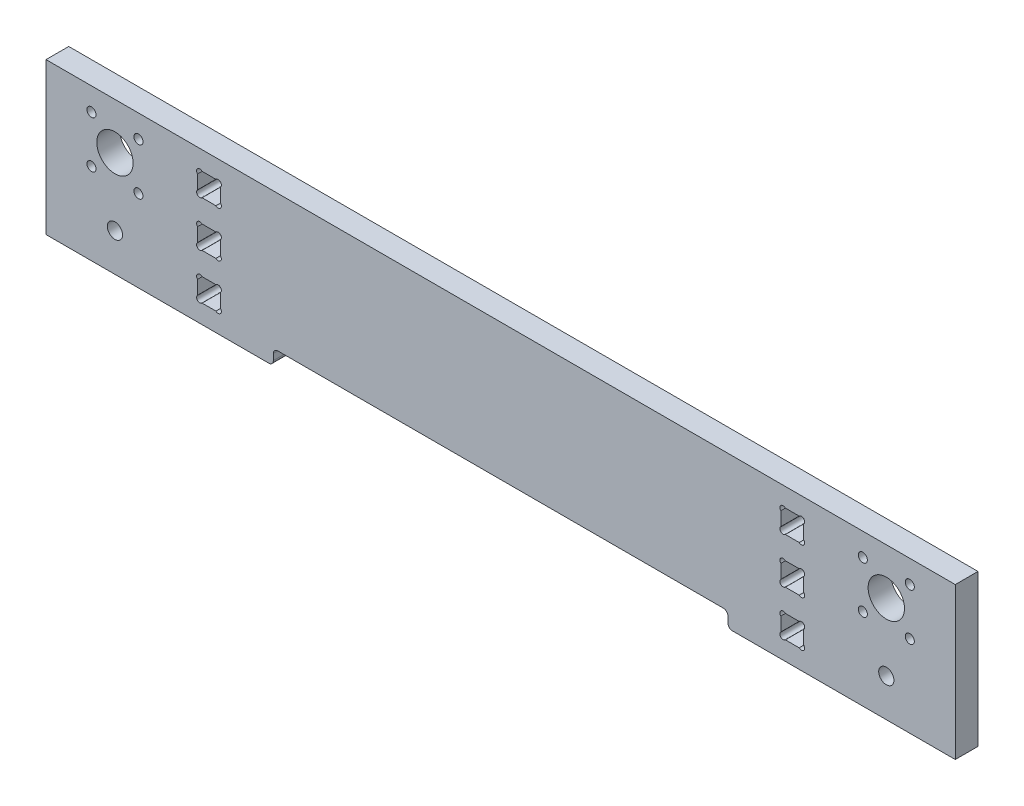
ISO-10303-21;
HEADER;
FILE_DESCRIPTION(('STEP AP214'),'2;1');
FILE_NAME('part.step','',(''),(''),'','','');
FILE_SCHEMA(('AUTOMOTIVE_DESIGN { 1 0 10303 214 1 1 1 1 }'));
ENDSEC;
DATA;
#1=APPLICATION_CONTEXT('core data for automotive mechanical design processes');
#2=APPLICATION_PROTOCOL_DEFINITION('international standard','automotive_design',2000,#1);
#3=PRODUCT_CONTEXT('',#1,'mechanical');
#4=PRODUCT('Part','Part','',(#3));
#5=PRODUCT_RELATED_PRODUCT_CATEGORY('part','',(#4));
#6=PRODUCT_DEFINITION_FORMATION('','',#4);
#7=PRODUCT_DEFINITION_CONTEXT('part definition',#1,'design');
#8=PRODUCT_DEFINITION('design','',#6,#7);
#9=PRODUCT_DEFINITION_SHAPE('','',#8);
#10=(LENGTH_UNIT() NAMED_UNIT(*) SI_UNIT(.MILLI.,.METRE.));
#11=(NAMED_UNIT(*) PLANE_ANGLE_UNIT() SI_UNIT($,.RADIAN.));
#12=(NAMED_UNIT(*) SI_UNIT($,.STERADIAN.) SOLID_ANGLE_UNIT());
#13=UNCERTAINTY_MEASURE_WITH_UNIT(LENGTH_MEASURE(1.E-05),#10,'distance_accuracy_value','');
#14=(GEOMETRIC_REPRESENTATION_CONTEXT(3) GLOBAL_UNCERTAINTY_ASSIGNED_CONTEXT((#13)) GLOBAL_UNIT_ASSIGNED_CONTEXT((#10,
#11,#12)) REPRESENTATION_CONTEXT('',''));
#15=CARTESIAN_POINT('',(0.,0.,0.));
#16=DIRECTION('',(0.,0.,1.));
#17=DIRECTION('',(1.,0.,0.));
#18=AXIS2_PLACEMENT_3D('',#15,#16,#17);
#19=CARTESIAN_POINT('',(45.5,25.,0.));
#20=DIRECTION('',(0.,0.,1.));
#21=DIRECTION('',(1.,0.,0.));
#22=AXIS2_PLACEMENT_3D('',#19,#20,#21);
#23=CYLINDRICAL_SURFACE('',#22,3.);
#24=CARTESIAN_POINT('',(45.5,25.,0.));
#25=DIRECTION('',(0.,0.,1.));
#26=DIRECTION('',(1.,0.,0.));
#27=AXIS2_PLACEMENT_3D('',#24,#25,#26);
#28=CIRCLE('',#27,3.);
#29=CARTESIAN_POINT('',(48.5,25.,0.));
#30=VERTEX_POINT('',#29);
#31=EDGE_CURVE('E1717',#30,#30,#28,.T.);
#32=ORIENTED_EDGE('',*,*,#31,.F.);
#33=EDGE_LOOP('',(#32));
#34=FACE_BOUND('',#33,.T.);
#35=CARTESIAN_POINT('',(45.5,25.,7.5));
#36=DIRECTION('',(0.,0.,1.));
#37=DIRECTION('',(1.,0.,0.));
#38=AXIS2_PLACEMENT_3D('',#35,#36,#37);
#39=CIRCLE('',#38,3.);
#40=CARTESIAN_POINT('',(48.5,25.,7.5));
#41=VERTEX_POINT('',#40);
#42=EDGE_CURVE('E864',#41,#41,#39,.F.);
#43=ORIENTED_EDGE('',*,*,#42,.F.);
#44=EDGE_LOOP('',(#43));
#45=FACE_BOUND('',#44,.T.);
#46=ADVANCED_FACE('F33',(#34,#45),#23,.F.);
#47=CARTESIAN_POINT('',(554.5,25.,0.));
#48=DIRECTION('',(0.,0.,1.));
#49=DIRECTION('',(1.,0.,0.));
#50=AXIS2_PLACEMENT_3D('',#47,#48,#49);
#51=CYLINDRICAL_SURFACE('',#50,3.00000000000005);
#52=CARTESIAN_POINT('',(554.5,25.,0.));
#53=DIRECTION('',(0.,0.,1.));
#54=DIRECTION('',(1.,0.,0.));
#55=AXIS2_PLACEMENT_3D('',#52,#53,#54);
#56=CIRCLE('',#55,3.00000000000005);
#57=CARTESIAN_POINT('',(557.5,25.,0.));
#58=VERTEX_POINT('',#57);
#59=EDGE_CURVE('E862',#58,#58,#56,.T.);
#60=ORIENTED_EDGE('',*,*,#59,.F.);
#61=EDGE_LOOP('',(#60));
#62=FACE_BOUND('',#61,.T.);
#63=CARTESIAN_POINT('',(554.5,25.,7.5));
#64=DIRECTION('',(0.,0.,1.));
#65=DIRECTION('',(1.,0.,0.));
#66=AXIS2_PLACEMENT_3D('',#63,#64,#65);
#67=CIRCLE('',#66,3.00000000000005);
#68=CARTESIAN_POINT('',(557.5,25.,7.5));
#69=VERTEX_POINT('',#68);
#70=EDGE_CURVE('E859',#69,#69,#67,.F.);
#71=ORIENTED_EDGE('',*,*,#70,.F.);
#72=EDGE_LOOP('',(#71));
#73=FACE_BOUND('',#72,.T.);
#74=ADVANCED_FACE('F964',(#62,#73),#51,.F.);
#75=CARTESIAN_POINT('',(0.,0.,15.));
#76=DIRECTION('',(0.,0.,-1.));
#77=DIRECTION('',(-1.,0.,0.));
#78=AXIS2_PLACEMENT_3D('',#75,#76,#77);
#79=PLANE('',#78);
#80=CARTESIAN_POINT('',(45.5,25.,15.));
#81=DIRECTION('',(0.,0.,1.));
#82=DIRECTION('',(1.,0.,0.));
#83=AXIS2_PLACEMENT_3D('',#80,#81,#82);
#84=CIRCLE('',#83,5.025);
#85=CARTESIAN_POINT('',(50.5249999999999,25.,15.));
#86=VERTEX_POINT('',#85);
#87=EDGE_CURVE('E1707',#86,#86,#84,.T.);
#88=ORIENTED_EDGE('',*,*,#87,.F.);
#89=EDGE_LOOP('',(#88));
#90=FACE_BOUND('',#89,.T.);
#91=CARTESIAN_POINT('',(554.5,25.,15.));
#92=DIRECTION('',(0.,0.,1.));
#93=DIRECTION('',(1.,0.,0.));
#94=AXIS2_PLACEMENT_3D('',#91,#92,#93);
#95=CIRCLE('',#94,5.025);
#96=CARTESIAN_POINT('',(559.525,25.,15.));
#97=VERTEX_POINT('',#96);
#98=EDGE_CURVE('E867',#97,#97,#95,.T.);
#99=ORIENTED_EDGE('',*,*,#98,.F.);
#100=EDGE_LOOP('',(#99));
#101=FACE_BOUND('',#100,.T.);
#102=CARTESIAN_POINT('',(539.,85.,15.));
#103=DIRECTION('',(0.,0.,1.));
#104=DIRECTION('',(1.,0.,0.));
#105=AXIS2_PLACEMENT_3D('',#102,#103,#104);
#106=CIRCLE('',#105,3.00000000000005);
#107=CARTESIAN_POINT('',(542.,85.,15.));
#108=VERTEX_POINT('',#107);
#109=EDGE_CURVE('E1721',#108,#108,#106,.T.);
#110=ORIENTED_EDGE('',*,*,#109,.F.);
#111=EDGE_LOOP('',(#110));
#112=FACE_BOUND('',#111,.T.);
#113=CARTESIAN_POINT('',(570.,85.,15.));
#114=DIRECTION('',(0.,0.,1.));
#115=DIRECTION('',(1.,0.,0.));
#116=AXIS2_PLACEMENT_3D('',#113,#114,#115);
#117=CIRCLE('',#116,3.00000000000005);
#118=CARTESIAN_POINT('',(573.,85.,15.));
#119=VERTEX_POINT('',#118);
#120=EDGE_CURVE('E1727',#119,#119,#117,.T.);
#121=ORIENTED_EDGE('',*,*,#120,.F.);
#122=EDGE_LOOP('',(#121));
#123=FACE_BOUND('',#122,.T.);
#124=CARTESIAN_POINT('',(570.,54.,15.));
#125=DIRECTION('',(0.,0.,1.));
#126=DIRECTION('',(1.,0.,0.));
#127=AXIS2_PLACEMENT_3D('',#124,#125,#126);
#128=CIRCLE('',#127,3.00000000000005);
#129=CARTESIAN_POINT('',(573.,54.,15.));
#130=VERTEX_POINT('',#129);
#131=EDGE_CURVE('E1733',#130,#130,#128,.T.);
#132=ORIENTED_EDGE('',*,*,#131,.F.);
#133=EDGE_LOOP('',(#132));
#134=FACE_BOUND('',#133,.T.);
#135=CARTESIAN_POINT('',(554.5,69.5,15.));
#136=DIRECTION('',(0.,0.,1.));
#137=DIRECTION('',(1.,0.,0.));
#138=AXIS2_PLACEMENT_3D('',#135,#136,#137);
#139=CIRCLE('',#138,12.);
#140=CARTESIAN_POINT('',(566.5,69.5,15.));
#141=VERTEX_POINT('',#140);
#142=EDGE_CURVE('E1739',#141,#141,#139,.T.);
#143=ORIENTED_EDGE('',*,*,#142,.F.);
#144=EDGE_LOOP('',(#143));
#145=FACE_BOUND('',#144,.T.);
#146=CARTESIAN_POINT('',(539.,54.,15.));
#147=DIRECTION('',(0.,0.,1.));
#148=DIRECTION('',(1.,0.,0.));
#149=AXIS2_PLACEMENT_3D('',#146,#147,#148);
#150=CIRCLE('',#149,3.00000000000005);
#151=CARTESIAN_POINT('',(542.,54.,15.));
#152=VERTEX_POINT('',#151);
#153=EDGE_CURVE('E421',#152,#152,#150,.T.);
#154=ORIENTED_EDGE('',*,*,#153,.F.);
#155=EDGE_LOOP('',(#154));
#156=FACE_BOUND('',#155,.T.);
#157=DIRECTION('',(-1.,0.,0.));
#158=VECTOR('',#157,1.);
#159=CARTESIAN_POINT('',(497.,27.4500000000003,15.));
#160=LINE('',#159,#158);
#161=CARTESIAN_POINT('',(497.,27.4500000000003,15.));
#162=VERTEX_POINT('',#161);
#163=CARTESIAN_POINT('',(487.9,27.4500000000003,15.));
#164=VERTEX_POINT('',#163);
#165=EDGE_CURVE('E435',#162,#164,#160,.T.);
#166=ORIENTED_EDGE('',*,*,#165,.F.);
#167=CARTESIAN_POINT('',(498.5,25.9500000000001,15.));
#168=DIRECTION('',(0.,0.,1.));
#169=DIRECTION('',(1.,0.,0.));
#170=AXIS2_PLACEMENT_3D('',#167,#168,#169);
#171=CIRCLE('',#170,2.12132034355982);
#172=CARTESIAN_POINT('',(500.,24.4499999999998,15.));
#173=VERTEX_POINT('',#172);
#174=EDGE_CURVE('E413',#173,#162,#171,.T.);
#175=ORIENTED_EDGE('',*,*,#174,.F.);
#176=DIRECTION('',(0.,1.,0.));
#177=VECTOR('',#176,1.);
#178=CARTESIAN_POINT('',(500.,15.3499999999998,15.));
#179=LINE('',#178,#177);
#180=CARTESIAN_POINT('',(500.,15.3499999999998,15.));
#181=VERTEX_POINT('',#180);
#182=EDGE_CURVE('E424',#181,#173,#179,.T.);
#183=ORIENTED_EDGE('',*,*,#182,.F.);
#184=CARTESIAN_POINT('',(498.5,13.8499999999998,15.));
#185=DIRECTION('',(0.,0.,1.));
#186=DIRECTION('',(1.,0.,0.));
#187=AXIS2_PLACEMENT_3D('',#184,#185,#186);
#188=CIRCLE('',#187,2.12132034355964);
#189=CARTESIAN_POINT('',(497.,12.3499999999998,15.));
#190=VERTEX_POINT('',#189);
#191=EDGE_CURVE('E429',#190,#181,#188,.T.);
#192=ORIENTED_EDGE('',*,*,#191,.F.);
#193=DIRECTION('',(1.,0.,0.));
#194=VECTOR('',#193,1.);
#195=CARTESIAN_POINT('',(487.9,12.3499999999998,15.));
#196=LINE('',#195,#194);
#197=CARTESIAN_POINT('',(487.9,12.3499999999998,15.));
#198=VERTEX_POINT('',#197);
#199=EDGE_CURVE('E1762',#198,#190,#196,.T.);
#200=ORIENTED_EDGE('',*,*,#199,.F.);
#201=CARTESIAN_POINT('',(486.4,13.8499999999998,15.));
#202=DIRECTION('',(0.,0.,1.));
#203=DIRECTION('',(1.,0.,0.));
#204=AXIS2_PLACEMENT_3D('',#201,#202,#203);
#205=CIRCLE('',#204,2.12132034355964);
#206=CARTESIAN_POINT('',(484.9,15.3499999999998,15.));
#207=VERTEX_POINT('',#206);
#208=EDGE_CURVE('E1765',#207,#198,#205,.T.);
#209=ORIENTED_EDGE('',*,*,#208,.F.);
#210=DIRECTION('',(0.,-1.,0.));
#211=VECTOR('',#210,1.);
#212=CARTESIAN_POINT('',(484.9,24.4499999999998,15.));
#213=LINE('',#212,#211);
#214=CARTESIAN_POINT('',(484.9,24.4499999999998,15.));
#215=VERTEX_POINT('',#214);
#216=EDGE_CURVE('E1768',#215,#207,#213,.T.);
#217=ORIENTED_EDGE('',*,*,#216,.F.);
#218=CARTESIAN_POINT('',(486.4,25.9500000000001,15.));
#219=DIRECTION('',(0.,0.,-1.));
#220=DIRECTION('',(-1.,0.,0.));
#221=AXIS2_PLACEMENT_3D('',#218,#219,#220);
#222=CIRCLE('',#221,2.12132034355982);
#223=EDGE_CURVE('E440',#215,#164,#222,.T.);
#224=ORIENTED_EDGE('',*,*,#223,.T.);
#225=EDGE_LOOP('',(#166,#175,#183,#192,#200,#209,#217,#224));
#226=FACE_BOUND('',#225,.T.);
#227=DIRECTION('',(0.,-1.,0.));
#228=VECTOR('',#227,1.);
#229=CARTESIAN_POINT('',(450.,0.,15.));
#230=LINE('',#229,#228);
#231=CARTESIAN_POINT('',(450.,6.99999999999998,15.));
#232=VERTEX_POINT('',#231);
#233=CARTESIAN_POINT('',(450.,2.99999999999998,15.));
#234=VERTEX_POINT('',#233);
#235=EDGE_CURVE('E818',#232,#234,#230,.T.);
#236=ORIENTED_EDGE('',*,*,#235,.T.);
#237=CARTESIAN_POINT('',(453.,2.99999999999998,15.));
#238=DIRECTION('',(0.,0.,-1.));
#239=DIRECTION('',(-1.,0.,0.));
#240=AXIS2_PLACEMENT_3D('',#237,#238,#239);
#241=CIRCLE('',#240,3.);
#242=CARTESIAN_POINT('',(453.,0.,15.));
#243=VERTEX_POINT('',#242);
#244=EDGE_CURVE('E882',#234,#243,#241,.F.);
#245=ORIENTED_EDGE('',*,*,#244,.T.);
#246=DIRECTION('',(1.,0.,0.));
#247=VECTOR('',#246,1.);
#248=CARTESIAN_POINT('',(600.,0.,15.));
#249=LINE('',#248,#247);
#250=CARTESIAN_POINT('',(600.,0.,15.));
#251=VERTEX_POINT('',#250);
#252=EDGE_CURVE('E821',#243,#251,#249,.T.);
#253=ORIENTED_EDGE('',*,*,#252,.T.);
#254=DIRECTION('',(0.,1.,0.));
#255=VECTOR('',#254,1.);
#256=CARTESIAN_POINT('',(600.,0.,15.));
#257=LINE('',#256,#255);
#258=CARTESIAN_POINT('',(600.,100.,15.));
#259=VERTEX_POINT('',#258);
#260=EDGE_CURVE('E823',#251,#259,#257,.T.);
#261=ORIENTED_EDGE('',*,*,#260,.T.);
#262=DIRECTION('',(-1.,0.,0.));
#263=VECTOR('',#262,1.);
#264=CARTESIAN_POINT('',(0.,100.,15.));
#265=LINE('',#264,#263);
#266=CARTESIAN_POINT('',(0.,100.,15.));
#267=VERTEX_POINT('',#266);
#268=EDGE_CURVE('E825',#259,#267,#265,.T.);
#269=ORIENTED_EDGE('',*,*,#268,.T.);
#270=DIRECTION('',(0.,-1.,0.));
#271=VECTOR('',#270,1.);
#272=CARTESIAN_POINT('',(0.,0.,15.));
#273=LINE('',#272,#271);
#274=CARTESIAN_POINT('',(0.,0.,15.));
#275=VERTEX_POINT('',#274);
#276=EDGE_CURVE('E827',#267,#275,#273,.T.);
#277=ORIENTED_EDGE('',*,*,#276,.T.);
#278=DIRECTION('',(1.,0.,0.));
#279=VECTOR('',#278,1.);
#280=CARTESIAN_POINT('',(150.,0.,15.));
#281=LINE('',#280,#279);
#282=CARTESIAN_POINT('',(147.,0.,15.));
#283=VERTEX_POINT('',#282);
#284=EDGE_CURVE('E810',#275,#283,#281,.T.);
#285=ORIENTED_EDGE('',*,*,#284,.T.);
#286=CARTESIAN_POINT('',(147.,3.00000000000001,15.));
#287=DIRECTION('',(0.,0.,-1.));
#288=DIRECTION('',(-1.,0.,0.));
#289=AXIS2_PLACEMENT_3D('',#286,#287,#288);
#290=CIRCLE('',#289,3.);
#291=CARTESIAN_POINT('',(150.,3.,15.));
#292=VERTEX_POINT('',#291);
#293=EDGE_CURVE('E880',#283,#292,#290,.F.);
#294=ORIENTED_EDGE('',*,*,#293,.T.);
#295=DIRECTION('',(0.,1.,0.));
#296=VECTOR('',#295,1.);
#297=CARTESIAN_POINT('',(150.,9.99999999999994,15.));
#298=LINE('',#297,#296);
#299=CARTESIAN_POINT('',(150.,6.99999999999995,15.));
#300=VERTEX_POINT('',#299);
#301=EDGE_CURVE('E813',#292,#300,#298,.T.);
#302=ORIENTED_EDGE('',*,*,#301,.T.);
#303=CARTESIAN_POINT('',(153.,6.99999999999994,15.));
#304=DIRECTION('',(0.,0.,-1.));
#305=DIRECTION('',(-1.,0.,0.));
#306=AXIS2_PLACEMENT_3D('',#303,#304,#305);
#307=CIRCLE('',#306,3.);
#308=CARTESIAN_POINT('',(153.,9.99999999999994,15.));
#309=VERTEX_POINT('',#308);
#310=EDGE_CURVE('E11',#300,#309,#307,.T.);
#311=ORIENTED_EDGE('',*,*,#310,.T.);
#312=DIRECTION('',(1.,0.,0.));
#313=VECTOR('',#312,1.);
#314=CARTESIAN_POINT('',(450.,9.99999999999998,15.));
#315=LINE('',#314,#313);
#316=CARTESIAN_POINT('',(447.,9.99999999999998,15.));
#317=VERTEX_POINT('',#316);
#318=EDGE_CURVE('E816',#309,#317,#315,.T.);
#319=ORIENTED_EDGE('',*,*,#318,.T.);
#320=CARTESIAN_POINT('',(447.,6.99999999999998,15.));
#321=DIRECTION('',(0.,0.,-1.));
#322=DIRECTION('',(-1.,0.,0.));
#323=AXIS2_PLACEMENT_3D('',#320,#321,#322);
#324=CIRCLE('',#323,3.);
#325=EDGE_CURVE('E897',#317,#232,#324,.T.);
#326=ORIENTED_EDGE('',*,*,#325,.T.);
#327=EDGE_LOOP('',(#236,#245,#253,#261,#269,#277,#285,#294,#302,#311,#319,#326));
#328=FACE_BOUND('',#327,.T.);
#329=CARTESIAN_POINT('',(498.5,86.1500000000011,15.));
#330=DIRECTION('',(0.,0.,1.));
#331=DIRECTION('',(1.,0.,0.));
#332=AXIS2_PLACEMENT_3D('',#329,#330,#331);
#333=CIRCLE('',#332,2.12132034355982);
#334=CARTESIAN_POINT('',(500.,84.6500000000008,15.));
#335=VERTEX_POINT('',#334);
#336=CARTESIAN_POINT('',(497.,87.6500000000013,15.));
#337=VERTEX_POINT('',#336);
#338=EDGE_CURVE('E773',#335,#337,#333,.T.);
#339=ORIENTED_EDGE('',*,*,#338,.F.);
#340=DIRECTION('',(0.,1.,0.));
#341=VECTOR('',#340,1.);
#342=CARTESIAN_POINT('',(500.,0.,15.));
#343=LINE('',#342,#341);
#344=CARTESIAN_POINT('',(500.,75.5500000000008,15.));
#345=VERTEX_POINT('',#344);
#346=EDGE_CURVE('E725',#345,#335,#343,.T.);
#347=ORIENTED_EDGE('',*,*,#346,.F.);
#348=CARTESIAN_POINT('',(498.5,74.0500000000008,15.));
#349=DIRECTION('',(0.,0.,1.));
#350=DIRECTION('',(1.,0.,0.));
#351=AXIS2_PLACEMENT_3D('',#348,#349,#350);
#352=CIRCLE('',#351,2.12132034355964);
#353=CARTESIAN_POINT('',(497.,72.5500000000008,15.));
#354=VERTEX_POINT('',#353);
#355=EDGE_CURVE('E751',#354,#345,#352,.T.);
#356=ORIENTED_EDGE('',*,*,#355,.F.);
#357=DIRECTION('',(1.,0.,0.));
#358=VECTOR('',#357,1.);
#359=CARTESIAN_POINT('',(-1.10641044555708E-13,72.5500000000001,15.));
#360=LINE('',#359,#358);
#361=CARTESIAN_POINT('',(487.9,72.5500000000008,15.));
#362=VERTEX_POINT('',#361);
#363=EDGE_CURVE('E788',#362,#354,#360,.T.);
#364=ORIENTED_EDGE('',*,*,#363,.F.);
#365=CARTESIAN_POINT('',(486.4,74.0500000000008,15.));
#366=DIRECTION('',(0.,0.,1.));
#367=DIRECTION('',(1.,0.,0.));
#368=AXIS2_PLACEMENT_3D('',#365,#366,#367);
#369=CIRCLE('',#368,2.12132034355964);
#370=CARTESIAN_POINT('',(484.9,75.5500000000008,15.));
#371=VERTEX_POINT('',#370);
#372=EDGE_CURVE('E785',#371,#362,#369,.T.);
#373=ORIENTED_EDGE('',*,*,#372,.F.);
#374=DIRECTION('',(0.,-1.,0.));
#375=VECTOR('',#374,1.);
#376=CARTESIAN_POINT('',(484.9,-2.95795134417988E-12,15.));
#377=LINE('',#376,#375);
#378=CARTESIAN_POINT('',(484.9,84.6500000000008,15.));
#379=VERTEX_POINT('',#378);
#380=EDGE_CURVE('E782',#379,#371,#377,.T.);
#381=ORIENTED_EDGE('',*,*,#380,.F.);
#382=CARTESIAN_POINT('',(486.4,86.1500000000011,15.));
#383=DIRECTION('',(0.,0.,1.));
#384=DIRECTION('',(1.,0.,0.));
#385=AXIS2_PLACEMENT_3D('',#382,#383,#384);
#386=CIRCLE('',#385,2.12132034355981);
#387=CARTESIAN_POINT('',(487.9,87.6500000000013,15.));
#388=VERTEX_POINT('',#387);
#389=EDGE_CURVE('E779',#379,#388,#386,.F.);
#390=ORIENTED_EDGE('',*,*,#389,.T.);
#391=DIRECTION('',(-1.,0.,0.));
#392=VECTOR('',#391,1.);
#393=CARTESIAN_POINT('',(0.,87.6500000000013,15.));
#394=LINE('',#393,#392);
#395=EDGE_CURVE('E776',#337,#388,#394,.T.);
#396=ORIENTED_EDGE('',*,*,#395,.F.);
#397=EDGE_LOOP('',(#339,#347,#356,#364,#373,#381,#390,#396));
#398=FACE_BOUND('',#397,.T.);
#399=CARTESIAN_POINT('',(113.6,86.1500000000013,15.));
#400=DIRECTION('',(0.,0.,1.));
#401=DIRECTION('',(1.,0.,0.));
#402=AXIS2_PLACEMENT_3D('',#399,#400,#401);
#403=CIRCLE('',#402,2.12132034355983);
#404=CARTESIAN_POINT('',(115.1,84.650000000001,15.));
#405=VERTEX_POINT('',#404);
#406=CARTESIAN_POINT('',(112.1,87.6500000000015,15.));
#407=VERTEX_POINT('',#406);
#408=EDGE_CURVE('E720',#405,#407,#403,.T.);
#409=ORIENTED_EDGE('',*,*,#408,.F.);
#410=DIRECTION('',(0.,1.,0.));
#411=VECTOR('',#410,1.);
#412=CARTESIAN_POINT('',(115.1,0.,15.));
#413=LINE('',#412,#411);
#414=CARTESIAN_POINT('',(115.1,75.550000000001,15.));
#415=VERTEX_POINT('',#414);
#416=EDGE_CURVE('E723',#415,#405,#413,.T.);
#417=ORIENTED_EDGE('',*,*,#416,.F.);
#418=CARTESIAN_POINT('',(113.6,74.050000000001,15.));
#419=DIRECTION('',(0.,0.,1.));
#420=DIRECTION('',(1.,0.,0.));
#421=AXIS2_PLACEMENT_3D('',#418,#419,#420);
#422=CIRCLE('',#421,2.12132034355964);
#423=CARTESIAN_POINT('',(112.1,72.550000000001,15.));
#424=VERTEX_POINT('',#423);
#425=EDGE_CURVE('E701',#424,#415,#422,.T.);
#426=ORIENTED_EDGE('',*,*,#425,.F.);
#427=DIRECTION('',(1.,0.,0.));
#428=VECTOR('',#427,1.);
#429=CARTESIAN_POINT('',(-1.10641044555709E-13,72.5500000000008,15.));
#430=LINE('',#429,#428);
#431=CARTESIAN_POINT('',(103.,72.550000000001,15.));
#432=VERTEX_POINT('',#431);
#433=EDGE_CURVE('E704',#432,#424,#430,.T.);
#434=ORIENTED_EDGE('',*,*,#433,.F.);
#435=CARTESIAN_POINT('',(101.5,74.050000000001,15.));
#436=DIRECTION('',(0.,0.,1.));
#437=DIRECTION('',(1.,0.,0.));
#438=AXIS2_PLACEMENT_3D('',#435,#436,#437);
#439=CIRCLE('',#438,2.12132034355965);
#440=CARTESIAN_POINT('',(100.,75.550000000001,15.));
#441=VERTEX_POINT('',#440);
#442=EDGE_CURVE('E708',#441,#432,#439,.T.);
#443=ORIENTED_EDGE('',*,*,#442,.F.);
#444=DIRECTION('',(0.,-1.,0.));
#445=VECTOR('',#444,1.);
#446=CARTESIAN_POINT('',(100.,0.,15.));
#447=LINE('',#446,#445);
#448=CARTESIAN_POINT('',(100.,84.650000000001,15.));
#449=VERTEX_POINT('',#448);
#450=EDGE_CURVE('E711',#449,#441,#447,.T.);
#451=ORIENTED_EDGE('',*,*,#450,.F.);
#452=CARTESIAN_POINT('',(101.5,86.1500000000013,15.));
#453=DIRECTION('',(0.,0.,1.));
#454=DIRECTION('',(1.,0.,0.));
#455=AXIS2_PLACEMENT_3D('',#452,#453,#454);
#456=CIRCLE('',#455,2.12132034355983);
#457=CARTESIAN_POINT('',(103.,87.6500000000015,15.));
#458=VERTEX_POINT('',#457);
#459=EDGE_CURVE('E714',#449,#458,#456,.F.);
#460=ORIENTED_EDGE('',*,*,#459,.T.);
#461=DIRECTION('',(-1.,0.,0.));
#462=VECTOR('',#461,1.);
#463=CARTESIAN_POINT('',(-1.33669022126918E-13,87.6500000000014,15.));
#464=LINE('',#463,#462);
#465=EDGE_CURVE('E717',#407,#458,#464,.T.);
#466=ORIENTED_EDGE('',*,*,#465,.F.);
#467=EDGE_LOOP('',(#409,#417,#426,#434,#443,#451,#460,#466));
#468=FACE_BOUND('',#467,.T.);
#469=CARTESIAN_POINT('',(113.6,56.0500000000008,15.));
#470=DIRECTION('',(0.,0.,1.));
#471=DIRECTION('',(1.,0.,0.));
#472=AXIS2_PLACEMENT_3D('',#469,#470,#471);
#473=CIRCLE('',#472,2.12132034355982);
#474=CARTESIAN_POINT('',(115.1,54.5500000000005,15.));
#475=VERTEX_POINT('',#474);
#476=CARTESIAN_POINT('',(112.1,57.550000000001,15.));
#477=VERTEX_POINT('',#476);
#478=EDGE_CURVE('E657',#475,#477,#473,.T.);
#479=ORIENTED_EDGE('',*,*,#478,.F.);
#480=DIRECTION('',(0.,1.,0.));
#481=VECTOR('',#480,1.);
#482=CARTESIAN_POINT('',(115.1,0.,15.));
#483=LINE('',#482,#481);
#484=CARTESIAN_POINT('',(115.1,45.4500000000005,15.));
#485=VERTEX_POINT('',#484);
#486=EDGE_CURVE('E660',#485,#475,#483,.T.);
#487=ORIENTED_EDGE('',*,*,#486,.F.);
#488=CARTESIAN_POINT('',(113.6,43.9500000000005,15.));
#489=DIRECTION('',(0.,0.,1.));
#490=DIRECTION('',(1.,0.,0.));
#491=AXIS2_PLACEMENT_3D('',#488,#489,#490);
#492=CIRCLE('',#491,2.12132034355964);
#493=CARTESIAN_POINT('',(112.1,42.4500000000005,15.));
#494=VERTEX_POINT('',#493);
#495=EDGE_CURVE('E638',#494,#485,#492,.T.);
#496=ORIENTED_EDGE('',*,*,#495,.F.);
#497=DIRECTION('',(1.,0.,0.));
#498=VECTOR('',#497,1.);
#499=CARTESIAN_POINT('',(0.,42.4500000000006,15.));
#500=LINE('',#499,#498);
#501=CARTESIAN_POINT('',(103.,42.4500000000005,15.));
#502=VERTEX_POINT('',#501);
#503=EDGE_CURVE('E641',#502,#494,#500,.T.);
#504=ORIENTED_EDGE('',*,*,#503,.F.);
#505=CARTESIAN_POINT('',(101.5,43.9500000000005,15.));
#506=DIRECTION('',(0.,0.,1.));
#507=DIRECTION('',(1.,0.,0.));
#508=AXIS2_PLACEMENT_3D('',#505,#506,#507);
#509=CIRCLE('',#508,2.12132034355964);
#510=CARTESIAN_POINT('',(100.,45.4500000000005,15.));
#511=VERTEX_POINT('',#510);
#512=EDGE_CURVE('E645',#511,#502,#509,.T.);
#513=ORIENTED_EDGE('',*,*,#512,.F.);
#514=DIRECTION('',(0.,-1.,0.));
#515=VECTOR('',#514,1.);
#516=CARTESIAN_POINT('',(100.,0.,15.));
#517=LINE('',#516,#515);
#518=CARTESIAN_POINT('',(100.,54.5500000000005,15.));
#519=VERTEX_POINT('',#518);
#520=EDGE_CURVE('E648',#519,#511,#517,.T.);
#521=ORIENTED_EDGE('',*,*,#520,.F.);
#522=CARTESIAN_POINT('',(101.5,56.0500000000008,15.));
#523=DIRECTION('',(0.,0.,1.));
#524=DIRECTION('',(1.,0.,0.));
#525=AXIS2_PLACEMENT_3D('',#522,#523,#524);
#526=CIRCLE('',#525,2.12132034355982);
#527=CARTESIAN_POINT('',(103.,57.550000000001,15.));
#528=VERTEX_POINT('',#527);
#529=EDGE_CURVE('E651',#519,#528,#526,.F.);
#530=ORIENTED_EDGE('',*,*,#529,.T.);
#531=DIRECTION('',(-1.,0.,0.));
#532=VECTOR('',#531,1.);
#533=CARTESIAN_POINT('',(0.,57.5500000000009,15.));
#534=LINE('',#533,#532);
#535=EDGE_CURVE('E654',#477,#528,#534,.T.);
#536=ORIENTED_EDGE('',*,*,#535,.F.);
#537=EDGE_LOOP('',(#479,#487,#496,#504,#513,#521,#530,#536));
#538=FACE_BOUND('',#537,.T.);
#539=CARTESIAN_POINT('',(113.6,25.9500000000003,15.));
#540=DIRECTION('',(0.,0.,1.));
#541=DIRECTION('',(1.,0.,0.));
#542=AXIS2_PLACEMENT_3D('',#539,#540,#541);
#543=CIRCLE('',#542,2.12132034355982);
#544=CARTESIAN_POINT('',(115.1,24.45,15.));
#545=VERTEX_POINT('',#544);
#546=CARTESIAN_POINT('',(112.1,27.4500000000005,15.));
#547=VERTEX_POINT('',#546);
#548=EDGE_CURVE('E594',#545,#547,#543,.T.);
#549=ORIENTED_EDGE('',*,*,#548,.F.);
#550=DIRECTION('',(0.,1.,0.));
#551=VECTOR('',#550,1.);
#552=CARTESIAN_POINT('',(115.1,0.,15.));
#553=LINE('',#552,#551);
#554=CARTESIAN_POINT('',(115.1,15.35,15.));
#555=VERTEX_POINT('',#554);
#556=EDGE_CURVE('E597',#555,#545,#553,.T.);
#557=ORIENTED_EDGE('',*,*,#556,.F.);
#558=CARTESIAN_POINT('',(113.6,13.85,15.));
#559=DIRECTION('',(0.,0.,1.));
#560=DIRECTION('',(1.,0.,0.));
#561=AXIS2_PLACEMENT_3D('',#558,#559,#560);
#562=CIRCLE('',#561,2.12132034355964);
#563=CARTESIAN_POINT('',(112.1,12.35,15.));
#564=VERTEX_POINT('',#563);
#565=EDGE_CURVE('E575',#564,#555,#562,.T.);
#566=ORIENTED_EDGE('',*,*,#565,.F.);
#567=DIRECTION('',(1.,0.,0.));
#568=VECTOR('',#567,1.);
#569=CARTESIAN_POINT('',(0.,12.35,15.));
#570=LINE('',#569,#568);
#571=CARTESIAN_POINT('',(103.,12.35,15.));
#572=VERTEX_POINT('',#571);
#573=EDGE_CURVE('E578',#572,#564,#570,.T.);
#574=ORIENTED_EDGE('',*,*,#573,.F.);
#575=CARTESIAN_POINT('',(101.5,13.85,15.));
#576=DIRECTION('',(0.,0.,1.));
#577=DIRECTION('',(1.,0.,0.));
#578=AXIS2_PLACEMENT_3D('',#575,#576,#577);
#579=CIRCLE('',#578,2.12132034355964);
#580=CARTESIAN_POINT('',(100.,15.35,15.));
#581=VERTEX_POINT('',#580);
#582=EDGE_CURVE('E582',#581,#572,#579,.T.);
#583=ORIENTED_EDGE('',*,*,#582,.F.);
#584=DIRECTION('',(0.,-1.,0.));
#585=VECTOR('',#584,1.);
#586=CARTESIAN_POINT('',(100.,0.,15.));
#587=LINE('',#586,#585);
#588=CARTESIAN_POINT('',(100.,24.45,15.));
#589=VERTEX_POINT('',#588);
#590=EDGE_CURVE('E585',#589,#581,#587,.T.);
#591=ORIENTED_EDGE('',*,*,#590,.F.);
#592=CARTESIAN_POINT('',(101.5,25.9500000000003,15.));
#593=DIRECTION('',(0.,0.,1.));
#594=DIRECTION('',(1.,0.,0.));
#595=AXIS2_PLACEMENT_3D('',#592,#593,#594);
#596=CIRCLE('',#595,2.12132034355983);
#597=CARTESIAN_POINT('',(103.,27.4500000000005,15.));
#598=VERTEX_POINT('',#597);
#599=EDGE_CURVE('E588',#589,#598,#596,.F.);
#600=ORIENTED_EDGE('',*,*,#599,.T.);
#601=DIRECTION('',(-1.,0.,0.));
#602=VECTOR('',#601,1.);
#603=CARTESIAN_POINT('',(0.,27.4500000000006,15.));
#604=LINE('',#603,#602);
#605=EDGE_CURVE('E591',#547,#598,#604,.T.);
#606=ORIENTED_EDGE('',*,*,#605,.F.);
#607=EDGE_LOOP('',(#549,#557,#566,#574,#583,#591,#600,#606));
#608=FACE_BOUND('',#607,.T.);
#609=CARTESIAN_POINT('',(45.5,69.5,15.));
#610=DIRECTION('',(0.,0.,1.));
#611=DIRECTION('',(1.,0.,0.));
#612=AXIS2_PLACEMENT_3D('',#609,#610,#611);
#613=CIRCLE('',#612,12.);
#614=CARTESIAN_POINT('',(57.4999999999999,69.5,15.));
#615=VERTEX_POINT('',#614);
#616=EDGE_CURVE('E552',#615,#615,#613,.T.);
#617=ORIENTED_EDGE('',*,*,#616,.F.);
#618=EDGE_LOOP('',(#617));
#619=FACE_BOUND('',#618,.T.);
#620=CARTESIAN_POINT('',(30.,54.,15.));
#621=DIRECTION('',(0.,0.,1.));
#622=DIRECTION('',(1.,0.,0.));
#623=AXIS2_PLACEMENT_3D('',#620,#621,#622);
#624=CIRCLE('',#623,3.);
#625=CARTESIAN_POINT('',(33.,54.,15.));
#626=VERTEX_POINT('',#625);
#627=EDGE_CURVE('E546',#626,#626,#624,.T.);
#628=ORIENTED_EDGE('',*,*,#627,.F.);
#629=EDGE_LOOP('',(#628));
#630=FACE_BOUND('',#629,.T.);
#631=CARTESIAN_POINT('',(30.,85.,15.));
#632=DIRECTION('',(0.,0.,1.));
#633=DIRECTION('',(1.,0.,0.));
#634=AXIS2_PLACEMENT_3D('',#631,#632,#633);
#635=CIRCLE('',#634,3.);
#636=CARTESIAN_POINT('',(33.,85.,15.));
#637=VERTEX_POINT('',#636);
#638=EDGE_CURVE('E540',#637,#637,#635,.T.);
#639=ORIENTED_EDGE('',*,*,#638,.F.);
#640=EDGE_LOOP('',(#639));
#641=FACE_BOUND('',#640,.T.);
#642=CARTESIAN_POINT('',(61.,85.,15.));
#643=DIRECTION('',(0.,0.,1.));
#644=DIRECTION('',(1.,0.,0.));
#645=AXIS2_PLACEMENT_3D('',#642,#643,#644);
#646=CIRCLE('',#645,3.00000000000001);
#647=CARTESIAN_POINT('',(64.,85.,15.));
#648=VERTEX_POINT('',#647);
#649=EDGE_CURVE('E534',#648,#648,#646,.T.);
#650=ORIENTED_EDGE('',*,*,#649,.F.);
#651=EDGE_LOOP('',(#650));
#652=FACE_BOUND('',#651,.T.);
#653=CARTESIAN_POINT('',(61.,54.,15.));
#654=DIRECTION('',(0.,0.,1.));
#655=DIRECTION('',(1.,0.,0.));
#656=AXIS2_PLACEMENT_3D('',#653,#654,#655);
#657=CIRCLE('',#656,3.00000000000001);
#658=CARTESIAN_POINT('',(64.,54.,15.));
#659=VERTEX_POINT('',#658);
#660=EDGE_CURVE('E528',#659,#659,#657,.T.);
#661=ORIENTED_EDGE('',*,*,#660,.F.);
#662=EDGE_LOOP('',(#661));
#663=FACE_BOUND('',#662,.T.);
#664=CARTESIAN_POINT('',(486.4,56.0500000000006,15.));
#665=DIRECTION('',(0.,0.,-1.));
#666=DIRECTION('',(-1.,0.,0.));
#667=AXIS2_PLACEMENT_3D('',#664,#665,#666);
#668=CIRCLE('',#667,2.12132034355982);
#669=CARTESIAN_POINT('',(484.9,54.5500000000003,15.));
#670=VERTEX_POINT('',#669);
#671=CARTESIAN_POINT('',(487.9,57.5500000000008,15.));
#672=VERTEX_POINT('',#671);
#673=EDGE_CURVE('E503',#670,#672,#668,.T.);
#674=ORIENTED_EDGE('',*,*,#673,.T.);
#675=DIRECTION('',(-1.,0.,0.));
#676=VECTOR('',#675,1.);
#677=CARTESIAN_POINT('',(497.,57.5500000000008,15.));
#678=LINE('',#677,#676);
#679=CARTESIAN_POINT('',(497.,57.5500000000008,15.));
#680=VERTEX_POINT('',#679);
#681=EDGE_CURVE('E500',#680,#672,#678,.T.);
#682=ORIENTED_EDGE('',*,*,#681,.F.);
#683=CARTESIAN_POINT('',(498.5,56.0500000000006,15.));
#684=DIRECTION('',(0.,0.,1.));
#685=DIRECTION('',(1.,0.,0.));
#686=AXIS2_PLACEMENT_3D('',#683,#684,#685);
#687=CIRCLE('',#686,2.12132034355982);
#688=CARTESIAN_POINT('',(500.,54.5500000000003,15.));
#689=VERTEX_POINT('',#688);
#690=EDGE_CURVE('E497',#689,#680,#687,.T.);
#691=ORIENTED_EDGE('',*,*,#690,.F.);
#692=DIRECTION('',(0.,1.,0.));
#693=VECTOR('',#692,1.);
#694=CARTESIAN_POINT('',(500.,45.4500000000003,15.));
#695=LINE('',#694,#693);
#696=CARTESIAN_POINT('',(500.,45.4500000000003,15.));
#697=VERTEX_POINT('',#696);
#698=EDGE_CURVE('E494',#697,#689,#695,.T.);
#699=ORIENTED_EDGE('',*,*,#698,.F.);
#700=CARTESIAN_POINT('',(498.5,43.9500000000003,15.));
#701=DIRECTION('',(0.,0.,1.));
#702=DIRECTION('',(1.,0.,0.));
#703=AXIS2_PLACEMENT_3D('',#700,#701,#702);
#704=CIRCLE('',#703,2.12132034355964);
#705=CARTESIAN_POINT('',(497.,42.4500000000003,15.));
#706=VERTEX_POINT('',#705);
#707=EDGE_CURVE('E491',#706,#697,#704,.T.);
#708=ORIENTED_EDGE('',*,*,#707,.F.);
#709=DIRECTION('',(1.,0.,0.));
#710=VECTOR('',#709,1.);
#711=CARTESIAN_POINT('',(487.9,42.4500000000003,15.));
#712=LINE('',#711,#710);
#713=CARTESIAN_POINT('',(487.9,42.4500000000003,15.));
#714=VERTEX_POINT('',#713);
#715=EDGE_CURVE('E488',#714,#706,#712,.T.);
#716=ORIENTED_EDGE('',*,*,#715,.F.);
#717=CARTESIAN_POINT('',(486.4,43.9500000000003,15.));
#718=DIRECTION('',(0.,0.,1.));
#719=DIRECTION('',(1.,0.,0.));
#720=AXIS2_PLACEMENT_3D('',#717,#718,#719);
#721=CIRCLE('',#720,2.12132034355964);
#722=CARTESIAN_POINT('',(484.9,45.4500000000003,15.));
#723=VERTEX_POINT('',#722);
#724=EDGE_CURVE('E484',#723,#714,#721,.T.);
#725=ORIENTED_EDGE('',*,*,#724,.F.);
#726=DIRECTION('',(0.,-1.,0.));
#727=VECTOR('',#726,1.);
#728=CARTESIAN_POINT('',(484.9,54.5500000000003,15.));
#729=LINE('',#728,#727);
#730=EDGE_CURVE('E481',#670,#723,#729,.T.);
#731=ORIENTED_EDGE('',*,*,#730,.F.);
#732=EDGE_LOOP('',(#674,#682,#691,#699,#708,#716,#725,#731));
#733=FACE_BOUND('',#732,.T.);
#734=ADVANCED_FACE('F432',(#90,#101,#112,#123,#134,#145,#156,#226,#328,#398,#468,#538,#608,#619,
#630,#641,#652,#663,#733),#79,.F.);
#735=CARTESIAN_POINT('',(0.,0.,0.));
#736=DIRECTION('',(0.,0.,-1.));
#737=DIRECTION('',(-1.,0.,0.));
#738=AXIS2_PLACEMENT_3D('',#735,#736,#737);
#739=PLANE('',#738);
#740=ORIENTED_EDGE('',*,*,#59,.T.);
#741=EDGE_LOOP('',(#740));
#742=FACE_BOUND('',#741,.T.);
#743=ORIENTED_EDGE('',*,*,#31,.T.);
#744=EDGE_LOOP('',(#743));
#745=FACE_BOUND('',#744,.T.);
#746=CARTESIAN_POINT('',(539.,85.,0.));
#747=DIRECTION('',(0.,0.,1.));
#748=DIRECTION('',(1.,0.,0.));
#749=AXIS2_PLACEMENT_3D('',#746,#747,#748);
#750=CIRCLE('',#749,3.00000000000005);
#751=CARTESIAN_POINT('',(542.,85.,0.));
#752=VERTEX_POINT('',#751);
#753=EDGE_CURVE('E1720',#752,#752,#750,.T.);
#754=ORIENTED_EDGE('',*,*,#753,.T.);
#755=EDGE_LOOP('',(#754));
#756=FACE_BOUND('',#755,.T.);
#757=CARTESIAN_POINT('',(570.,85.,0.));
#758=DIRECTION('',(0.,0.,1.));
#759=DIRECTION('',(1.,0.,0.));
#760=AXIS2_PLACEMENT_3D('',#757,#758,#759);
#761=CIRCLE('',#760,3.00000000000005);
#762=CARTESIAN_POINT('',(573.,85.,0.));
#763=VERTEX_POINT('',#762);
#764=EDGE_CURVE('E1724',#763,#763,#761,.T.);
#765=ORIENTED_EDGE('',*,*,#764,.T.);
#766=EDGE_LOOP('',(#765));
#767=FACE_BOUND('',#766,.T.);
#768=CARTESIAN_POINT('',(570.,54.,0.));
#769=DIRECTION('',(0.,0.,1.));
#770=DIRECTION('',(1.,0.,0.));
#771=AXIS2_PLACEMENT_3D('',#768,#769,#770);
#772=CIRCLE('',#771,3.00000000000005);
#773=CARTESIAN_POINT('',(573.,54.,0.));
#774=VERTEX_POINT('',#773);
#775=EDGE_CURVE('E1730',#774,#774,#772,.T.);
#776=ORIENTED_EDGE('',*,*,#775,.T.);
#777=EDGE_LOOP('',(#776));
#778=FACE_BOUND('',#777,.T.);
#779=CARTESIAN_POINT('',(554.5,69.5,0.));
#780=DIRECTION('',(0.,0.,1.));
#781=DIRECTION('',(1.,0.,0.));
#782=AXIS2_PLACEMENT_3D('',#779,#780,#781);
#783=CIRCLE('',#782,12.);
#784=CARTESIAN_POINT('',(566.5,69.5,0.));
#785=VERTEX_POINT('',#784);
#786=EDGE_CURVE('E1736',#785,#785,#783,.T.);
#787=ORIENTED_EDGE('',*,*,#786,.T.);
#788=EDGE_LOOP('',(#787));
#789=FACE_BOUND('',#788,.T.);
#790=CARTESIAN_POINT('',(539.,54.,0.));
#791=DIRECTION('',(0.,0.,1.));
#792=DIRECTION('',(1.,0.,0.));
#793=AXIS2_PLACEMENT_3D('',#790,#791,#792);
#794=CIRCLE('',#793,3.00000000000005);
#795=CARTESIAN_POINT('',(542.,54.,0.));
#796=VERTEX_POINT('',#795);
#797=EDGE_CURVE('E1742',#796,#796,#794,.T.);
#798=ORIENTED_EDGE('',*,*,#797,.T.);
#799=EDGE_LOOP('',(#798));
#800=FACE_BOUND('',#799,.T.);
#801=CARTESIAN_POINT('',(498.5,25.9500000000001,0.));
#802=DIRECTION('',(0.,0.,1.));
#803=DIRECTION('',(1.,0.,0.));
#804=AXIS2_PLACEMENT_3D('',#801,#802,#803);
#805=CIRCLE('',#804,2.12132034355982);
#806=CARTESIAN_POINT('',(500.,24.4499999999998,0.));
#807=VERTEX_POINT('',#806);
#808=CARTESIAN_POINT('',(497.,27.4500000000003,0.));
#809=VERTEX_POINT('',#808);
#810=EDGE_CURVE('E416',#807,#809,#805,.T.);
#811=ORIENTED_EDGE('',*,*,#810,.T.);
#812=DIRECTION('',(-1.,0.,0.));
#813=VECTOR('',#812,1.);
#814=CARTESIAN_POINT('',(497.,27.4500000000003,0.));
#815=LINE('',#814,#813);
#816=CARTESIAN_POINT('',(487.9,27.4500000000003,0.));
#817=VERTEX_POINT('',#816);
#818=EDGE_CURVE('E462',#809,#817,#815,.T.);
#819=ORIENTED_EDGE('',*,*,#818,.T.);
#820=CARTESIAN_POINT('',(486.4,25.9500000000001,0.));
#821=DIRECTION('',(0.,0.,-1.));
#822=DIRECTION('',(-1.,0.,0.));
#823=AXIS2_PLACEMENT_3D('',#820,#821,#822);
#824=CIRCLE('',#823,2.12132034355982);
#825=CARTESIAN_POINT('',(484.9,24.4499999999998,0.));
#826=VERTEX_POINT('',#825);
#827=EDGE_CURVE('E459',#826,#817,#824,.T.);
#828=ORIENTED_EDGE('',*,*,#827,.F.);
#829=DIRECTION('',(0.,-1.,0.));
#830=VECTOR('',#829,1.);
#831=CARTESIAN_POINT('',(484.9,24.4499999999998,0.));
#832=LINE('',#831,#830);
#833=CARTESIAN_POINT('',(484.9,15.3499999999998,0.));
#834=VERTEX_POINT('',#833);
#835=EDGE_CURVE('E456',#826,#834,#832,.T.);
#836=ORIENTED_EDGE('',*,*,#835,.T.);
#837=CARTESIAN_POINT('',(486.4,13.8499999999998,0.));
#838=DIRECTION('',(0.,0.,1.));
#839=DIRECTION('',(1.,0.,0.));
#840=AXIS2_PLACEMENT_3D('',#837,#838,#839);
#841=CIRCLE('',#840,2.12132034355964);
#842=CARTESIAN_POINT('',(487.9,12.3499999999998,0.));
#843=VERTEX_POINT('',#842);
#844=EDGE_CURVE('E453',#834,#843,#841,.T.);
#845=ORIENTED_EDGE('',*,*,#844,.T.);
#846=DIRECTION('',(1.,0.,0.));
#847=VECTOR('',#846,1.);
#848=CARTESIAN_POINT('',(487.9,12.3499999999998,0.));
#849=LINE('',#848,#847);
#850=CARTESIAN_POINT('',(497.,12.3499999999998,0.));
#851=VERTEX_POINT('',#850);
#852=EDGE_CURVE('E450',#843,#851,#849,.T.);
#853=ORIENTED_EDGE('',*,*,#852,.T.);
#854=CARTESIAN_POINT('',(498.5,13.8499999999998,0.));
#855=DIRECTION('',(0.,0.,1.));
#856=DIRECTION('',(1.,0.,0.));
#857=AXIS2_PLACEMENT_3D('',#854,#855,#856);
#858=CIRCLE('',#857,2.12132034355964);
#859=CARTESIAN_POINT('',(500.,15.3499999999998,0.));
#860=VERTEX_POINT('',#859);
#861=EDGE_CURVE('E446',#851,#860,#858,.T.);
#862=ORIENTED_EDGE('',*,*,#861,.T.);
#863=DIRECTION('',(0.,1.,0.));
#864=VECTOR('',#863,1.);
#865=CARTESIAN_POINT('',(500.,15.3499999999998,0.));
#866=LINE('',#865,#864);
#867=EDGE_CURVE('E444',#860,#807,#866,.T.);
#868=ORIENTED_EDGE('',*,*,#867,.T.);
#869=EDGE_LOOP('',(#811,#819,#828,#836,#845,#853,#862,#868));
#870=FACE_BOUND('',#869,.T.);
#871=DIRECTION('',(1.,0.,0.));
#872=VECTOR('',#871,1.);
#873=CARTESIAN_POINT('',(600.,0.,0.));
#874=LINE('',#873,#872);
#875=CARTESIAN_POINT('',(453.,0.,0.));
#876=VERTEX_POINT('',#875);
#877=CARTESIAN_POINT('',(600.,0.,0.));
#878=VERTEX_POINT('',#877);
#879=EDGE_CURVE('E840',#876,#878,#874,.T.);
#880=ORIENTED_EDGE('',*,*,#879,.F.);
#881=CARTESIAN_POINT('',(453.,2.99999999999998,0.));
#882=DIRECTION('',(0.,0.,-1.));
#883=DIRECTION('',(-1.,0.,0.));
#884=AXIS2_PLACEMENT_3D('',#881,#882,#883);
#885=CIRCLE('',#884,3.);
#886=CARTESIAN_POINT('',(450.,2.99999999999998,0.));
#887=VERTEX_POINT('',#886);
#888=EDGE_CURVE('E873',#876,#887,#885,.T.);
#889=ORIENTED_EDGE('',*,*,#888,.T.);
#890=DIRECTION('',(0.,-1.,0.));
#891=VECTOR('',#890,1.);
#892=CARTESIAN_POINT('',(450.,0.,0.));
#893=LINE('',#892,#891);
#894=CARTESIAN_POINT('',(450.,6.99999999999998,0.));
#895=VERTEX_POINT('',#894);
#896=EDGE_CURVE('E837',#895,#887,#893,.T.);
#897=ORIENTED_EDGE('',*,*,#896,.F.);
#898=CARTESIAN_POINT('',(447.,6.99999999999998,0.));
#899=DIRECTION('',(0.,0.,-1.));
#900=DIRECTION('',(-1.,0.,0.));
#901=AXIS2_PLACEMENT_3D('',#898,#899,#900);
#902=CIRCLE('',#901,3.);
#903=CARTESIAN_POINT('',(447.,9.99999999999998,0.));
#904=VERTEX_POINT('',#903);
#905=EDGE_CURVE('E895',#895,#904,#902,.F.);
#906=ORIENTED_EDGE('',*,*,#905,.T.);
#907=DIRECTION('',(1.,0.,0.));
#908=VECTOR('',#907,1.);
#909=CARTESIAN_POINT('',(450.,9.99999999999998,0.));
#910=LINE('',#909,#908);
#911=CARTESIAN_POINT('',(153.,9.99999999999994,0.));
#912=VERTEX_POINT('',#911);
#913=EDGE_CURVE('E835',#912,#904,#910,.T.);
#914=ORIENTED_EDGE('',*,*,#913,.F.);
#915=CARTESIAN_POINT('',(153.,6.99999999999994,0.));
#916=DIRECTION('',(0.,0.,-1.));
#917=DIRECTION('',(-1.,0.,0.));
#918=AXIS2_PLACEMENT_3D('',#915,#916,#917);
#919=CIRCLE('',#918,3.);
#920=CARTESIAN_POINT('',(150.,6.99999999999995,0.));
#921=VERTEX_POINT('',#920);
#922=EDGE_CURVE('E41',#912,#921,#919,.F.);
#923=ORIENTED_EDGE('',*,*,#922,.T.);
#924=DIRECTION('',(0.,1.,0.));
#925=VECTOR('',#924,1.);
#926=CARTESIAN_POINT('',(150.,9.99999999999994,0.));
#927=LINE('',#926,#925);
#928=CARTESIAN_POINT('',(150.,3.,0.));
#929=VERTEX_POINT('',#928);
#930=EDGE_CURVE('E832',#929,#921,#927,.T.);
#931=ORIENTED_EDGE('',*,*,#930,.F.);
#932=CARTESIAN_POINT('',(147.,3.00000000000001,0.));
#933=DIRECTION('',(0.,0.,-1.));
#934=DIRECTION('',(-1.,0.,0.));
#935=AXIS2_PLACEMENT_3D('',#932,#933,#934);
#936=CIRCLE('',#935,3.);
#937=CARTESIAN_POINT('',(147.,0.,0.));
#938=VERTEX_POINT('',#937);
#939=EDGE_CURVE('E871',#929,#938,#936,.T.);
#940=ORIENTED_EDGE('',*,*,#939,.T.);
#941=DIRECTION('',(1.,0.,0.));
#942=VECTOR('',#941,1.);
#943=CARTESIAN_POINT('',(150.,0.,0.));
#944=LINE('',#943,#942);
#945=CARTESIAN_POINT('',(0.,0.,0.));
#946=VERTEX_POINT('',#945);
#947=EDGE_CURVE('E795',#946,#938,#944,.T.);
#948=ORIENTED_EDGE('',*,*,#947,.F.);
#949=DIRECTION('',(0.,-1.,0.));
#950=VECTOR('',#949,1.);
#951=CARTESIAN_POINT('',(0.,0.,0.));
#952=LINE('',#951,#950);
#953=CARTESIAN_POINT('',(0.,100.,0.));
#954=VERTEX_POINT('',#953);
#955=EDGE_CURVE('E814',#954,#946,#952,.T.);
#956=ORIENTED_EDGE('',*,*,#955,.F.);
#957=DIRECTION('',(-1.,0.,0.));
#958=VECTOR('',#957,1.);
#959=CARTESIAN_POINT('',(0.,100.,0.));
#960=LINE('',#959,#958);
#961=CARTESIAN_POINT('',(600.,100.,0.));
#962=VERTEX_POINT('',#961);
#963=EDGE_CURVE('E844',#962,#954,#960,.T.);
#964=ORIENTED_EDGE('',*,*,#963,.F.);
#965=DIRECTION('',(0.,1.,0.));
#966=VECTOR('',#965,1.);
#967=CARTESIAN_POINT('',(600.,0.,0.));
#968=LINE('',#967,#966);
#969=EDGE_CURVE('E842',#878,#962,#968,.T.);
#970=ORIENTED_EDGE('',*,*,#969,.F.);
#971=EDGE_LOOP('',(#880,#889,#897,#906,#914,#923,#931,#940,#948,#956,#964,#970));
#972=FACE_BOUND('',#971,.T.);
#973=DIRECTION('',(0.,1.,0.));
#974=VECTOR('',#973,1.);
#975=CARTESIAN_POINT('',(500.,0.,0.));
#976=LINE('',#975,#974);
#977=CARTESIAN_POINT('',(500.,75.5500000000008,0.));
#978=VERTEX_POINT('',#977);
#979=CARTESIAN_POINT('',(500.,84.6500000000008,0.));
#980=VERTEX_POINT('',#979);
#981=EDGE_CURVE('E747',#978,#980,#976,.T.);
#982=ORIENTED_EDGE('',*,*,#981,.T.);
#983=CARTESIAN_POINT('',(498.5,86.1500000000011,0.));
#984=DIRECTION('',(0.,0.,1.));
#985=DIRECTION('',(1.,0.,0.));
#986=AXIS2_PLACEMENT_3D('',#983,#984,#985);
#987=CIRCLE('',#986,2.12132034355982);
#988=CARTESIAN_POINT('',(497.,87.6500000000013,0.));
#989=VERTEX_POINT('',#988);
#990=EDGE_CURVE('E750',#980,#989,#987,.T.);
#991=ORIENTED_EDGE('',*,*,#990,.T.);
#992=DIRECTION('',(-1.,0.,0.));
#993=VECTOR('',#992,1.);
#994=CARTESIAN_POINT('',(0.,87.6500000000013,0.));
#995=LINE('',#994,#993);
#996=CARTESIAN_POINT('',(487.9,87.6500000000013,0.));
#997=VERTEX_POINT('',#996);
#998=EDGE_CURVE('E754',#989,#997,#995,.T.);
#999=ORIENTED_EDGE('',*,*,#998,.T.);
#1000=CARTESIAN_POINT('',(486.4,86.1500000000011,0.));
#1001=DIRECTION('',(0.,0.,1.));
#1002=DIRECTION('',(1.,0.,0.));
#1003=AXIS2_PLACEMENT_3D('',#1000,#1001,#1002);
#1004=CIRCLE('',#1003,2.12132034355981);
#1005=CARTESIAN_POINT('',(484.9,84.6500000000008,0.));
#1006=VERTEX_POINT('',#1005);
#1007=EDGE_CURVE('E757',#1006,#997,#1004,.F.);
#1008=ORIENTED_EDGE('',*,*,#1007,.F.);
#1009=DIRECTION('',(0.,-1.,0.));
#1010=VECTOR('',#1009,1.);
#1011=CARTESIAN_POINT('',(484.9,-2.95795134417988E-12,0.));
#1012=LINE('',#1011,#1010);
#1013=CARTESIAN_POINT('',(484.9,75.5500000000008,0.));
#1014=VERTEX_POINT('',#1013);
#1015=EDGE_CURVE('E759',#1006,#1014,#1012,.T.);
#1016=ORIENTED_EDGE('',*,*,#1015,.T.);
#1017=CARTESIAN_POINT('',(486.4,74.0500000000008,0.));
#1018=DIRECTION('',(0.,0.,1.));
#1019=DIRECTION('',(1.,0.,0.));
#1020=AXIS2_PLACEMENT_3D('',#1017,#1018,#1019);
#1021=CIRCLE('',#1020,2.12132034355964);
#1022=CARTESIAN_POINT('',(487.9,72.5500000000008,0.));
#1023=VERTEX_POINT('',#1022);
#1024=EDGE_CURVE('E762',#1014,#1023,#1021,.T.);
#1025=ORIENTED_EDGE('',*,*,#1024,.T.);
#1026=DIRECTION('',(1.,0.,0.));
#1027=VECTOR('',#1026,1.);
#1028=CARTESIAN_POINT('',(-1.10641044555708E-13,72.5500000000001,0.));
#1029=LINE('',#1028,#1027);
#1030=CARTESIAN_POINT('',(497.,72.5500000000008,0.));
#1031=VERTEX_POINT('',#1030);
#1032=EDGE_CURVE('E765',#1023,#1031,#1029,.T.);
#1033=ORIENTED_EDGE('',*,*,#1032,.T.);
#1034=CARTESIAN_POINT('',(498.5,74.0500000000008,0.));
#1035=DIRECTION('',(0.,0.,1.));
#1036=DIRECTION('',(1.,0.,0.));
#1037=AXIS2_PLACEMENT_3D('',#1034,#1035,#1036);
#1038=CIRCLE('',#1037,2.12132034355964);
#1039=EDGE_CURVE('E768',#1031,#978,#1038,.T.);
#1040=ORIENTED_EDGE('',*,*,#1039,.T.);
#1041=EDGE_LOOP('',(#982,#991,#999,#1008,#1016,#1025,#1033,#1040));
#1042=FACE_BOUND('',#1041,.T.);
#1043=DIRECTION('',(0.,1.,0.));
#1044=VECTOR('',#1043,1.);
#1045=CARTESIAN_POINT('',(115.1,0.,0.));
#1046=LINE('',#1045,#1044);
#1047=CARTESIAN_POINT('',(115.1,75.550000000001,0.));
#1048=VERTEX_POINT('',#1047);
#1049=CARTESIAN_POINT('',(115.1,84.650000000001,0.));
#1050=VERTEX_POINT('',#1049);
#1051=EDGE_CURVE('E705',#1048,#1050,#1046,.T.);
#1052=ORIENTED_EDGE('',*,*,#1051,.T.);
#1053=CARTESIAN_POINT('',(113.6,86.1500000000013,0.));
#1054=DIRECTION('',(0.,0.,1.));
#1055=DIRECTION('',(1.,0.,0.));
#1056=AXIS2_PLACEMENT_3D('',#1053,#1054,#1055);
#1057=CIRCLE('',#1056,2.12132034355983);
#1058=CARTESIAN_POINT('',(112.1,87.6500000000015,0.));
#1059=VERTEX_POINT('',#1058);
#1060=EDGE_CURVE('E742',#1050,#1059,#1057,.T.);
#1061=ORIENTED_EDGE('',*,*,#1060,.T.);
#1062=DIRECTION('',(-1.,0.,0.));
#1063=VECTOR('',#1062,1.);
#1064=CARTESIAN_POINT('',(-1.33669022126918E-13,87.6500000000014,0.));
#1065=LINE('',#1064,#1063);
#1066=CARTESIAN_POINT('',(103.,87.6500000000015,0.));
#1067=VERTEX_POINT('',#1066);
#1068=EDGE_CURVE('E739',#1059,#1067,#1065,.T.);
#1069=ORIENTED_EDGE('',*,*,#1068,.T.);
#1070=CARTESIAN_POINT('',(101.5,86.1500000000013,0.));
#1071=DIRECTION('',(0.,0.,1.));
#1072=DIRECTION('',(1.,0.,0.));
#1073=AXIS2_PLACEMENT_3D('',#1070,#1071,#1072);
#1074=CIRCLE('',#1073,2.12132034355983);
#1075=CARTESIAN_POINT('',(100.,84.650000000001,0.));
#1076=VERTEX_POINT('',#1075);
#1077=EDGE_CURVE('E737',#1076,#1067,#1074,.F.);
#1078=ORIENTED_EDGE('',*,*,#1077,.F.);
#1079=DIRECTION('',(0.,-1.,0.));
#1080=VECTOR('',#1079,1.);
#1081=CARTESIAN_POINT('',(100.,0.,0.));
#1082=LINE('',#1081,#1080);
#1083=CARTESIAN_POINT('',(100.,75.550000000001,0.));
#1084=VERTEX_POINT('',#1083);
#1085=EDGE_CURVE('E734',#1076,#1084,#1082,.T.);
#1086=ORIENTED_EDGE('',*,*,#1085,.T.);
#1087=CARTESIAN_POINT('',(101.5,74.050000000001,0.));
#1088=DIRECTION('',(0.,0.,1.));
#1089=DIRECTION('',(1.,0.,0.));
#1090=AXIS2_PLACEMENT_3D('',#1087,#1088,#1089);
#1091=CIRCLE('',#1090,2.12132034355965);
#1092=CARTESIAN_POINT('',(103.,72.550000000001,0.));
#1093=VERTEX_POINT('',#1092);
#1094=EDGE_CURVE('E731',#1084,#1093,#1091,.T.);
#1095=ORIENTED_EDGE('',*,*,#1094,.T.);
#1096=DIRECTION('',(1.,0.,0.));
#1097=VECTOR('',#1096,1.);
#1098=CARTESIAN_POINT('',(-1.10641044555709E-13,72.5500000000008,0.));
#1099=LINE('',#1098,#1097);
#1100=CARTESIAN_POINT('',(112.1,72.550000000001,0.));
#1101=VERTEX_POINT('',#1100);
#1102=EDGE_CURVE('E728',#1093,#1101,#1099,.T.);
#1103=ORIENTED_EDGE('',*,*,#1102,.T.);
#1104=CARTESIAN_POINT('',(113.6,74.050000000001,0.));
#1105=DIRECTION('',(0.,0.,1.));
#1106=DIRECTION('',(1.,0.,0.));
#1107=AXIS2_PLACEMENT_3D('',#1104,#1105,#1106);
#1108=CIRCLE('',#1107,2.12132034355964);
#1109=EDGE_CURVE('E687',#1101,#1048,#1108,.T.);
#1110=ORIENTED_EDGE('',*,*,#1109,.T.);
#1111=EDGE_LOOP('',(#1052,#1061,#1069,#1078,#1086,#1095,#1103,#1110));
#1112=FACE_BOUND('',#1111,.T.);
#1113=DIRECTION('',(0.,1.,0.));
#1114=VECTOR('',#1113,1.);
#1115=CARTESIAN_POINT('',(115.1,0.,0.));
#1116=LINE('',#1115,#1114);
#1117=CARTESIAN_POINT('',(115.1,45.4500000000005,0.));
#1118=VERTEX_POINT('',#1117);
#1119=CARTESIAN_POINT('',(115.1,54.5500000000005,0.));
#1120=VERTEX_POINT('',#1119);
#1121=EDGE_CURVE('E642',#1118,#1120,#1116,.T.);
#1122=ORIENTED_EDGE('',*,*,#1121,.T.);
#1123=CARTESIAN_POINT('',(113.6,56.0500000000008,0.));
#1124=DIRECTION('',(0.,0.,1.));
#1125=DIRECTION('',(1.,0.,0.));
#1126=AXIS2_PLACEMENT_3D('',#1123,#1124,#1125);
#1127=CIRCLE('',#1126,2.12132034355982);
#1128=CARTESIAN_POINT('',(112.1,57.550000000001,0.));
#1129=VERTEX_POINT('',#1128);
#1130=EDGE_CURVE('E679',#1120,#1129,#1127,.T.);
#1131=ORIENTED_EDGE('',*,*,#1130,.T.);
#1132=DIRECTION('',(-1.,0.,0.));
#1133=VECTOR('',#1132,1.);
#1134=CARTESIAN_POINT('',(0.,57.5500000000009,0.));
#1135=LINE('',#1134,#1133);
#1136=CARTESIAN_POINT('',(103.,57.550000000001,0.));
#1137=VERTEX_POINT('',#1136);
#1138=EDGE_CURVE('E676',#1129,#1137,#1135,.T.);
#1139=ORIENTED_EDGE('',*,*,#1138,.T.);
#1140=CARTESIAN_POINT('',(101.5,56.0500000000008,0.));
#1141=DIRECTION('',(0.,0.,1.));
#1142=DIRECTION('',(1.,0.,0.));
#1143=AXIS2_PLACEMENT_3D('',#1140,#1141,#1142);
#1144=CIRCLE('',#1143,2.12132034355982);
#1145=CARTESIAN_POINT('',(100.,54.5500000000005,0.));
#1146=VERTEX_POINT('',#1145);
#1147=EDGE_CURVE('E674',#1146,#1137,#1144,.F.);
#1148=ORIENTED_EDGE('',*,*,#1147,.F.);
#1149=DIRECTION('',(0.,-1.,0.));
#1150=VECTOR('',#1149,1.);
#1151=CARTESIAN_POINT('',(100.,0.,0.));
#1152=LINE('',#1151,#1150);
#1153=CARTESIAN_POINT('',(100.,45.4500000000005,0.));
#1154=VERTEX_POINT('',#1153);
#1155=EDGE_CURVE('E671',#1146,#1154,#1152,.T.);
#1156=ORIENTED_EDGE('',*,*,#1155,.T.);
#1157=CARTESIAN_POINT('',(101.5,43.9500000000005,0.));
#1158=DIRECTION('',(0.,0.,1.));
#1159=DIRECTION('',(1.,0.,0.));
#1160=AXIS2_PLACEMENT_3D('',#1157,#1158,#1159);
#1161=CIRCLE('',#1160,2.12132034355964);
#1162=CARTESIAN_POINT('',(103.,42.4500000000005,0.));
#1163=VERTEX_POINT('',#1162);
#1164=EDGE_CURVE('E668',#1154,#1163,#1161,.T.);
#1165=ORIENTED_EDGE('',*,*,#1164,.T.);
#1166=DIRECTION('',(1.,0.,0.));
#1167=VECTOR('',#1166,1.);
#1168=CARTESIAN_POINT('',(0.,42.4500000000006,0.));
#1169=LINE('',#1168,#1167);
#1170=CARTESIAN_POINT('',(112.1,42.4500000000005,0.));
#1171=VERTEX_POINT('',#1170);
#1172=EDGE_CURVE('E665',#1163,#1171,#1169,.T.);
#1173=ORIENTED_EDGE('',*,*,#1172,.T.);
#1174=CARTESIAN_POINT('',(113.6,43.9500000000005,0.));
#1175=DIRECTION('',(0.,0.,1.));
#1176=DIRECTION('',(1.,0.,0.));
#1177=AXIS2_PLACEMENT_3D('',#1174,#1175,#1176);
#1178=CIRCLE('',#1177,2.12132034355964);
#1179=EDGE_CURVE('E624',#1171,#1118,#1178,.T.);
#1180=ORIENTED_EDGE('',*,*,#1179,.T.);
#1181=EDGE_LOOP('',(#1122,#1131,#1139,#1148,#1156,#1165,#1173,#1180));
#1182=FACE_BOUND('',#1181,.T.);
#1183=DIRECTION('',(0.,1.,0.));
#1184=VECTOR('',#1183,1.);
#1185=CARTESIAN_POINT('',(115.1,0.,0.));
#1186=LINE('',#1185,#1184);
#1187=CARTESIAN_POINT('',(115.1,15.35,0.));
#1188=VERTEX_POINT('',#1187);
#1189=CARTESIAN_POINT('',(115.1,24.45,0.));
#1190=VERTEX_POINT('',#1189);
#1191=EDGE_CURVE('E579',#1188,#1190,#1186,.T.);
#1192=ORIENTED_EDGE('',*,*,#1191,.T.);
#1193=CARTESIAN_POINT('',(113.6,25.9500000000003,0.));
#1194=DIRECTION('',(0.,0.,1.));
#1195=DIRECTION('',(1.,0.,0.));
#1196=AXIS2_PLACEMENT_3D('',#1193,#1194,#1195);
#1197=CIRCLE('',#1196,2.12132034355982);
#1198=CARTESIAN_POINT('',(112.1,27.4500000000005,0.));
#1199=VERTEX_POINT('',#1198);
#1200=EDGE_CURVE('E616',#1190,#1199,#1197,.T.);
#1201=ORIENTED_EDGE('',*,*,#1200,.T.);
#1202=DIRECTION('',(-1.,0.,0.));
#1203=VECTOR('',#1202,1.);
#1204=CARTESIAN_POINT('',(0.,27.4500000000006,0.));
#1205=LINE('',#1204,#1203);
#1206=CARTESIAN_POINT('',(103.,27.4500000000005,0.));
#1207=VERTEX_POINT('',#1206);
#1208=EDGE_CURVE('E613',#1199,#1207,#1205,.T.);
#1209=ORIENTED_EDGE('',*,*,#1208,.T.);
#1210=CARTESIAN_POINT('',(101.5,25.9500000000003,0.));
#1211=DIRECTION('',(0.,0.,1.));
#1212=DIRECTION('',(1.,0.,0.));
#1213=AXIS2_PLACEMENT_3D('',#1210,#1211,#1212);
#1214=CIRCLE('',#1213,2.12132034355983);
#1215=CARTESIAN_POINT('',(100.,24.45,0.));
#1216=VERTEX_POINT('',#1215);
#1217=EDGE_CURVE('E611',#1216,#1207,#1214,.F.);
#1218=ORIENTED_EDGE('',*,*,#1217,.F.);
#1219=DIRECTION('',(0.,-1.,0.));
#1220=VECTOR('',#1219,1.);
#1221=CARTESIAN_POINT('',(100.,0.,0.));
#1222=LINE('',#1221,#1220);
#1223=CARTESIAN_POINT('',(100.,15.35,0.));
#1224=VERTEX_POINT('',#1223);
#1225=EDGE_CURVE('E608',#1216,#1224,#1222,.T.);
#1226=ORIENTED_EDGE('',*,*,#1225,.T.);
#1227=CARTESIAN_POINT('',(101.5,13.85,0.));
#1228=DIRECTION('',(0.,0.,1.));
#1229=DIRECTION('',(1.,0.,0.));
#1230=AXIS2_PLACEMENT_3D('',#1227,#1228,#1229);
#1231=CIRCLE('',#1230,2.12132034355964);
#1232=CARTESIAN_POINT('',(103.,12.35,0.));
#1233=VERTEX_POINT('',#1232);
#1234=EDGE_CURVE('E605',#1224,#1233,#1231,.T.);
#1235=ORIENTED_EDGE('',*,*,#1234,.T.);
#1236=DIRECTION('',(1.,0.,0.));
#1237=VECTOR('',#1236,1.);
#1238=CARTESIAN_POINT('',(0.,12.35,0.));
#1239=LINE('',#1238,#1237);
#1240=CARTESIAN_POINT('',(112.1,12.35,0.));
#1241=VERTEX_POINT('',#1240);
#1242=EDGE_CURVE('E602',#1233,#1241,#1239,.T.);
#1243=ORIENTED_EDGE('',*,*,#1242,.T.);
#1244=CARTESIAN_POINT('',(113.6,13.85,0.));
#1245=DIRECTION('',(0.,0.,1.));
#1246=DIRECTION('',(1.,0.,0.));
#1247=AXIS2_PLACEMENT_3D('',#1244,#1245,#1246);
#1248=CIRCLE('',#1247,2.12132034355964);
#1249=EDGE_CURVE('E561',#1241,#1188,#1248,.T.);
#1250=ORIENTED_EDGE('',*,*,#1249,.T.);
#1251=EDGE_LOOP('',(#1192,#1201,#1209,#1218,#1226,#1235,#1243,#1250));
#1252=FACE_BOUND('',#1251,.T.);
#1253=CARTESIAN_POINT('',(45.5,69.5,0.));
#1254=DIRECTION('',(0.,0.,1.));
#1255=DIRECTION('',(1.,0.,0.));
#1256=AXIS2_PLACEMENT_3D('',#1253,#1254,#1255);
#1257=CIRCLE('',#1256,12.);
#1258=CARTESIAN_POINT('',(57.4999999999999,69.5,0.));
#1259=VERTEX_POINT('',#1258);
#1260=EDGE_CURVE('E549',#1259,#1259,#1257,.T.);
#1261=ORIENTED_EDGE('',*,*,#1260,.T.);
#1262=EDGE_LOOP('',(#1261));
#1263=FACE_BOUND('',#1262,.T.);
#1264=CARTESIAN_POINT('',(30.,54.,0.));
#1265=DIRECTION('',(0.,0.,1.));
#1266=DIRECTION('',(1.,0.,0.));
#1267=AXIS2_PLACEMENT_3D('',#1264,#1265,#1266);
#1268=CIRCLE('',#1267,3.);
#1269=CARTESIAN_POINT('',(33.,54.,0.));
#1270=VERTEX_POINT('',#1269);
#1271=EDGE_CURVE('E543',#1270,#1270,#1268,.T.);
#1272=ORIENTED_EDGE('',*,*,#1271,.T.);
#1273=EDGE_LOOP('',(#1272));
#1274=FACE_BOUND('',#1273,.T.);
#1275=CARTESIAN_POINT('',(30.,85.,0.));
#1276=DIRECTION('',(0.,0.,1.));
#1277=DIRECTION('',(1.,0.,0.));
#1278=AXIS2_PLACEMENT_3D('',#1275,#1276,#1277);
#1279=CIRCLE('',#1278,3.);
#1280=CARTESIAN_POINT('',(33.,85.,0.));
#1281=VERTEX_POINT('',#1280);
#1282=EDGE_CURVE('E537',#1281,#1281,#1279,.T.);
#1283=ORIENTED_EDGE('',*,*,#1282,.T.);
#1284=EDGE_LOOP('',(#1283));
#1285=FACE_BOUND('',#1284,.T.);
#1286=CARTESIAN_POINT('',(61.,85.,0.));
#1287=DIRECTION('',(0.,0.,1.));
#1288=DIRECTION('',(1.,0.,0.));
#1289=AXIS2_PLACEMENT_3D('',#1286,#1287,#1288);
#1290=CIRCLE('',#1289,3.00000000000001);
#1291=CARTESIAN_POINT('',(64.,85.,0.));
#1292=VERTEX_POINT('',#1291);
#1293=EDGE_CURVE('E531',#1292,#1292,#1290,.T.);
#1294=ORIENTED_EDGE('',*,*,#1293,.T.);
#1295=EDGE_LOOP('',(#1294));
#1296=FACE_BOUND('',#1295,.T.);
#1297=CARTESIAN_POINT('',(61.,54.,0.));
#1298=DIRECTION('',(0.,0.,1.));
#1299=DIRECTION('',(1.,0.,0.));
#1300=AXIS2_PLACEMENT_3D('',#1297,#1298,#1299);
#1301=CIRCLE('',#1300,3.00000000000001);
#1302=CARTESIAN_POINT('',(64.,54.,0.));
#1303=VERTEX_POINT('',#1302);
#1304=EDGE_CURVE('E506',#1303,#1303,#1301,.T.);
#1305=ORIENTED_EDGE('',*,*,#1304,.T.);
#1306=EDGE_LOOP('',(#1305));
#1307=FACE_BOUND('',#1306,.T.);
#1308=DIRECTION('',(-1.,0.,0.));
#1309=VECTOR('',#1308,1.);
#1310=CARTESIAN_POINT('',(497.,57.5500000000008,0.));
#1311=LINE('',#1310,#1309);
#1312=CARTESIAN_POINT('',(497.,57.5500000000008,0.));
#1313=VERTEX_POINT('',#1312);
#1314=CARTESIAN_POINT('',(487.9,57.5500000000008,0.));
#1315=VERTEX_POINT('',#1314);
#1316=EDGE_CURVE('E524',#1313,#1315,#1311,.T.);
#1317=ORIENTED_EDGE('',*,*,#1316,.T.);
#1318=CARTESIAN_POINT('',(486.4,56.0500000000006,0.));
#1319=DIRECTION('',(0.,0.,-1.));
#1320=DIRECTION('',(-1.,0.,0.));
#1321=AXIS2_PLACEMENT_3D('',#1318,#1319,#1320);
#1322=CIRCLE('',#1321,2.12132034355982);
#1323=CARTESIAN_POINT('',(484.9,54.5500000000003,0.));
#1324=VERTEX_POINT('',#1323);
#1325=EDGE_CURVE('E485',#1324,#1315,#1322,.T.);
#1326=ORIENTED_EDGE('',*,*,#1325,.F.);
#1327=DIRECTION('',(0.,-1.,0.));
#1328=VECTOR('',#1327,1.);
#1329=CARTESIAN_POINT('',(484.9,54.5500000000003,0.));
#1330=LINE('',#1329,#1328);
#1331=CARTESIAN_POINT('',(484.9,45.4500000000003,0.));
#1332=VERTEX_POINT('',#1331);
#1333=EDGE_CURVE('E480',#1324,#1332,#1330,.T.);
#1334=ORIENTED_EDGE('',*,*,#1333,.T.);
#1335=CARTESIAN_POINT('',(486.4,43.9500000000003,0.));
#1336=DIRECTION('',(0.,0.,1.));
#1337=DIRECTION('',(1.,0.,0.));
#1338=AXIS2_PLACEMENT_3D('',#1335,#1336,#1337);
#1339=CIRCLE('',#1338,2.12132034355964);
#1340=CARTESIAN_POINT('',(487.9,42.4500000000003,0.));
#1341=VERTEX_POINT('',#1340);
#1342=EDGE_CURVE('E509',#1332,#1341,#1339,.T.);
#1343=ORIENTED_EDGE('',*,*,#1342,.T.);
#1344=DIRECTION('',(1.,0.,0.));
#1345=VECTOR('',#1344,1.);
#1346=CARTESIAN_POINT('',(487.9,42.4500000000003,0.));
#1347=LINE('',#1346,#1345);
#1348=CARTESIAN_POINT('',(497.,42.4500000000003,0.));
#1349=VERTEX_POINT('',#1348);
#1350=EDGE_CURVE('E512',#1341,#1349,#1347,.T.);
#1351=ORIENTED_EDGE('',*,*,#1350,.T.);
#1352=CARTESIAN_POINT('',(498.5,43.9500000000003,0.));
#1353=DIRECTION('',(0.,0.,1.));
#1354=DIRECTION('',(1.,0.,0.));
#1355=AXIS2_PLACEMENT_3D('',#1352,#1353,#1354);
#1356=CIRCLE('',#1355,2.12132034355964);
#1357=CARTESIAN_POINT('',(500.,45.4500000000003,0.));
#1358=VERTEX_POINT('',#1357);
#1359=EDGE_CURVE('E515',#1349,#1358,#1356,.T.);
#1360=ORIENTED_EDGE('',*,*,#1359,.T.);
#1361=DIRECTION('',(0.,1.,0.));
#1362=VECTOR('',#1361,1.);
#1363=CARTESIAN_POINT('',(500.,45.4500000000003,0.));
#1364=LINE('',#1363,#1362);
#1365=CARTESIAN_POINT('',(500.,54.5500000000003,0.));
#1366=VERTEX_POINT('',#1365);
#1367=EDGE_CURVE('E518',#1358,#1366,#1364,.T.);
#1368=ORIENTED_EDGE('',*,*,#1367,.T.);
#1369=CARTESIAN_POINT('',(498.5,56.0500000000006,0.));
#1370=DIRECTION('',(0.,0.,1.));
#1371=DIRECTION('',(1.,0.,0.));
#1372=AXIS2_PLACEMENT_3D('',#1369,#1370,#1371);
#1373=CIRCLE('',#1372,2.12132034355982);
#1374=EDGE_CURVE('E521',#1366,#1313,#1373,.T.);
#1375=ORIENTED_EDGE('',*,*,#1374,.T.);
#1376=EDGE_LOOP('',(#1317,#1326,#1334,#1343,#1351,#1360,#1368,#1375));
#1377=FACE_BOUND('',#1376,.T.);
#1378=ADVANCED_FACE('F902',(#742,#745,#756,#767,#778,#789,#800,#870,#972,#1042,#1112,#1182,
#1252,#1263,#1274,#1285,#1296,#1307,#1377),#739,.T.);
#1379=CARTESIAN_POINT('',(150.,0.,15.));
#1380=DIRECTION('',(0.,1.,0.));
#1381=DIRECTION('',(-1.,0.,0.));
#1382=AXIS2_PLACEMENT_3D('',#1379,#1380,#1381);
#1383=PLANE('',#1382);
#1384=ORIENTED_EDGE('',*,*,#947,.T.);
#1385=DIRECTION('',(0.,0.,-1.));
#1386=VECTOR('',#1385,1.);
#1387=CARTESIAN_POINT('',(147.,0.,15.));
#1388=LINE('',#1387,#1386);
#1389=EDGE_CURVE('E893',#938,#283,#1388,.F.);
#1390=ORIENTED_EDGE('',*,*,#1389,.T.);
#1391=ORIENTED_EDGE('',*,*,#284,.F.);
#1392=DIRECTION('',(0.,0.,-1.));
#1393=VECTOR('',#1392,1.);
#1394=CARTESIAN_POINT('',(0.,0.,15.));
#1395=LINE('',#1394,#1393);
#1396=EDGE_CURVE('E829',#275,#946,#1395,.T.);
#1397=ORIENTED_EDGE('',*,*,#1396,.T.);
#1398=EDGE_LOOP('',(#1384,#1390,#1391,#1397));
#1399=FACE_BOUND('',#1398,.T.);
#1400=ADVANCED_FACE('F952',(#1399),#1383,.F.);
#1401=CARTESIAN_POINT('',(150.,9.99999999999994,15.));
#1402=DIRECTION('',(-1.,0.,0.));
#1403=DIRECTION('',(0.,-1.,0.));
#1404=AXIS2_PLACEMENT_3D('',#1401,#1402,#1403);
#1405=PLANE('',#1404);
#1406=ORIENTED_EDGE('',*,*,#930,.T.);
#1407=DIRECTION('',(0.,0.,-1.));
#1408=VECTOR('',#1407,1.);
#1409=CARTESIAN_POINT('',(150.,6.99999999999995,15.));
#1410=LINE('',#1409,#1408);
#1411=EDGE_CURVE('E891',#921,#300,#1410,.F.);
#1412=ORIENTED_EDGE('',*,*,#1411,.T.);
#1413=ORIENTED_EDGE('',*,*,#301,.F.);
#1414=DIRECTION('',(0.,0.,-1.));
#1415=VECTOR('',#1414,1.);
#1416=CARTESIAN_POINT('',(150.,3.,15.));
#1417=LINE('',#1416,#1415);
#1418=EDGE_CURVE('E888',#292,#929,#1417,.T.);
#1419=ORIENTED_EDGE('',*,*,#1418,.T.);
#1420=EDGE_LOOP('',(#1406,#1412,#1413,#1419));
#1421=FACE_BOUND('',#1420,.T.);
#1422=ADVANCED_FACE('F908',(#1421),#1405,.F.);
#1423=CARTESIAN_POINT('',(450.,9.99999999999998,15.));
#1424=DIRECTION('',(0.,1.,0.));
#1425=DIRECTION('',(-1.,0.,0.));
#1426=AXIS2_PLACEMENT_3D('',#1423,#1424,#1425);
#1427=PLANE('',#1426);
#1428=ORIENTED_EDGE('',*,*,#913,.T.);
#1429=DIRECTION('',(0.,0.,-1.));
#1430=VECTOR('',#1429,1.);
#1431=CARTESIAN_POINT('',(447.,9.99999999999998,15.));
#1432=LINE('',#1431,#1430);
#1433=EDGE_CURVE('E48',#904,#317,#1432,.F.);
#1434=ORIENTED_EDGE('',*,*,#1433,.T.);
#1435=ORIENTED_EDGE('',*,*,#318,.F.);
#1436=DIRECTION('',(0.,0.,-1.));
#1437=VECTOR('',#1436,1.);
#1438=CARTESIAN_POINT('',(153.,9.99999999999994,0.));
#1439=LINE('',#1438,#1437);
#1440=EDGE_CURVE('E884',#309,#912,#1439,.T.);
#1441=ORIENTED_EDGE('',*,*,#1440,.T.);
#1442=EDGE_LOOP('',(#1428,#1434,#1435,#1441));
#1443=FACE_BOUND('',#1442,.T.);
#1444=ADVANCED_FACE('F912',(#1443),#1427,.F.);
#1445=CARTESIAN_POINT('',(450.,0.,15.));
#1446=DIRECTION('',(1.,0.,0.));
#1447=DIRECTION('',(0.,0.,-1.));
#1448=AXIS2_PLACEMENT_3D('',#1445,#1446,#1447);
#1449=PLANE('',#1448);
#1450=ORIENTED_EDGE('',*,*,#896,.T.);
#1451=DIRECTION('',(0.,0.,-1.));
#1452=VECTOR('',#1451,1.);
#1453=CARTESIAN_POINT('',(450.,2.99999999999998,15.));
#1454=LINE('',#1453,#1452);
#1455=EDGE_CURVE('E878',#887,#234,#1454,.F.);
#1456=ORIENTED_EDGE('',*,*,#1455,.T.);
#1457=ORIENTED_EDGE('',*,*,#235,.F.);
#1458=DIRECTION('',(0.,0.,-1.));
#1459=VECTOR('',#1458,1.);
#1460=CARTESIAN_POINT('',(450.,6.99999999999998,0.));
#1461=LINE('',#1460,#1459);
#1462=EDGE_CURVE('E875',#232,#895,#1461,.T.);
#1463=ORIENTED_EDGE('',*,*,#1462,.T.);
#1464=EDGE_LOOP('',(#1450,#1456,#1457,#1463));
#1465=FACE_BOUND('',#1464,.T.);
#1466=ADVANCED_FACE('F921',(#1465),#1449,.F.);
#1467=CARTESIAN_POINT('',(600.,0.,15.));
#1468=DIRECTION('',(0.,1.,0.));
#1469=DIRECTION('',(-1.,0.,0.));
#1470=AXIS2_PLACEMENT_3D('',#1467,#1468,#1469);
#1471=PLANE('',#1470);
#1472=ORIENTED_EDGE('',*,*,#252,.F.);
#1473=DIRECTION('',(0.,0.,-1.));
#1474=VECTOR('',#1473,1.);
#1475=CARTESIAN_POINT('',(453.,0.,15.));
#1476=LINE('',#1475,#1474);
#1477=EDGE_CURVE('E858',#243,#876,#1476,.T.);
#1478=ORIENTED_EDGE('',*,*,#1477,.T.);
#1479=ORIENTED_EDGE('',*,*,#879,.T.);
#1480=DIRECTION('',(0.,0.,-1.));
#1481=VECTOR('',#1480,1.);
#1482=CARTESIAN_POINT('',(600.,0.,15.));
#1483=LINE('',#1482,#1481);
#1484=EDGE_CURVE('E855',#251,#878,#1483,.T.);
#1485=ORIENTED_EDGE('',*,*,#1484,.F.);
#1486=EDGE_LOOP('',(#1472,#1478,#1479,#1485));
#1487=FACE_BOUND('',#1486,.T.);
#1488=ADVANCED_FACE('F930',(#1487),#1471,.F.);
#1489=CARTESIAN_POINT('',(600.,0.,15.));
#1490=DIRECTION('',(-1.,0.,0.));
#1491=DIRECTION('',(0.,0.,1.));
#1492=AXIS2_PLACEMENT_3D('',#1489,#1490,#1491);
#1493=PLANE('',#1492);
#1494=ORIENTED_EDGE('',*,*,#969,.T.);
#1495=DIRECTION('',(0.,0.,-1.));
#1496=VECTOR('',#1495,1.);
#1497=CARTESIAN_POINT('',(600.,100.,15.));
#1498=LINE('',#1497,#1496);
#1499=EDGE_CURVE('E852',#259,#962,#1498,.T.);
#1500=ORIENTED_EDGE('',*,*,#1499,.F.);
#1501=ORIENTED_EDGE('',*,*,#260,.F.);
#1502=ORIENTED_EDGE('',*,*,#1484,.T.);
#1503=EDGE_LOOP('',(#1494,#1500,#1501,#1502));
#1504=FACE_BOUND('',#1503,.T.);
#1505=ADVANCED_FACE('F937',(#1504),#1493,.F.);
#1506=CARTESIAN_POINT('',(0.,100.,15.));
#1507=DIRECTION('',(0.,-1.,0.));
#1508=DIRECTION('',(0.,0.,-1.));
#1509=AXIS2_PLACEMENT_3D('',#1506,#1507,#1508);
#1510=PLANE('',#1509);
#1511=ORIENTED_EDGE('',*,*,#963,.T.);
#1512=DIRECTION('',(0.,0.,-1.));
#1513=VECTOR('',#1512,1.);
#1514=CARTESIAN_POINT('',(0.,100.,15.));
#1515=LINE('',#1514,#1513);
#1516=EDGE_CURVE('E849',#267,#954,#1515,.T.);
#1517=ORIENTED_EDGE('',*,*,#1516,.F.);
#1518=ORIENTED_EDGE('',*,*,#268,.F.);
#1519=ORIENTED_EDGE('',*,*,#1499,.T.);
#1520=EDGE_LOOP('',(#1511,#1517,#1518,#1519));
#1521=FACE_BOUND('',#1520,.T.);
#1522=ADVANCED_FACE('F940',(#1521),#1510,.F.);
#1523=CARTESIAN_POINT('',(0.,0.,15.));
#1524=DIRECTION('',(1.,0.,0.));
#1525=DIRECTION('',(0.,0.,-1.));
#1526=AXIS2_PLACEMENT_3D('',#1523,#1524,#1525);
#1527=PLANE('',#1526);
#1528=ORIENTED_EDGE('',*,*,#955,.T.);
#1529=ORIENTED_EDGE('',*,*,#1396,.F.);
#1530=ORIENTED_EDGE('',*,*,#276,.F.);
#1531=ORIENTED_EDGE('',*,*,#1516,.T.);
#1532=EDGE_LOOP('',(#1528,#1529,#1530,#1531));
#1533=FACE_BOUND('',#1532,.T.);
#1534=ADVANCED_FACE('F945',(#1533),#1527,.F.);
#1535=CARTESIAN_POINT('',(500.,0.,0.));
#1536=DIRECTION('',(1.,0.,0.));
#1537=DIRECTION('',(0.,0.,-1.));
#1538=AXIS2_PLACEMENT_3D('',#1535,#1536,#1537);
#1539=PLANE('',#1538);
#1540=ORIENTED_EDGE('',*,*,#346,.T.);
#1541=DIRECTION('',(0.,0.,1.));
#1542=VECTOR('',#1541,1.);
#1543=CARTESIAN_POINT('',(500.,84.6500000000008,0.));
#1544=LINE('',#1543,#1542);
#1545=EDGE_CURVE('E771',#980,#335,#1544,.T.);
#1546=ORIENTED_EDGE('',*,*,#1545,.F.);
#1547=ORIENTED_EDGE('',*,*,#981,.F.);
#1548=DIRECTION('',(0.,0.,1.));
#1549=VECTOR('',#1548,1.);
#1550=CARTESIAN_POINT('',(500.,75.5500000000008,0.));
#1551=LINE('',#1550,#1549);
#1552=EDGE_CURVE('E793',#978,#345,#1551,.T.);
#1553=ORIENTED_EDGE('',*,*,#1552,.T.);
#1554=EDGE_LOOP('',(#1540,#1546,#1547,#1553));
#1555=FACE_BOUND('',#1554,.T.);
#1556=ADVANCED_FACE('F1178',(#1555),#1539,.F.);
#1557=CARTESIAN_POINT('',(498.5,74.0500000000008,0.));
#1558=DIRECTION('',(0.,0.,1.));
#1559=DIRECTION('',(1.,0.,0.));
#1560=AXIS2_PLACEMENT_3D('',#1557,#1558,#1559);
#1561=CYLINDRICAL_SURFACE('',#1560,2.12132034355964);
#1562=ORIENTED_EDGE('',*,*,#355,.T.);
#1563=ORIENTED_EDGE('',*,*,#1552,.F.);
#1564=ORIENTED_EDGE('',*,*,#1039,.F.);
#1565=DIRECTION('',(0.,0.,1.));
#1566=VECTOR('',#1565,1.);
#1567=CARTESIAN_POINT('',(497.,72.5500000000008,0.));
#1568=LINE('',#1567,#1566);
#1569=EDGE_CURVE('E796',#1031,#354,#1568,.T.);
#1570=ORIENTED_EDGE('',*,*,#1569,.T.);
#1571=EDGE_LOOP('',(#1562,#1563,#1564,#1570));
#1572=FACE_BOUND('',#1571,.T.);
#1573=ADVANCED_FACE('F1174',(#1572),#1561,.F.);
#1574=CARTESIAN_POINT('',(-1.10641044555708E-13,72.5500000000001,0.));
#1575=DIRECTION('',(0.,-1.,0.));
#1576=DIRECTION('',(1.,0.,0.));
#1577=AXIS2_PLACEMENT_3D('',#1574,#1575,#1576);
#1578=PLANE('',#1577);
#1579=ORIENTED_EDGE('',*,*,#363,.T.);
#1580=ORIENTED_EDGE('',*,*,#1569,.F.);
#1581=ORIENTED_EDGE('',*,*,#1032,.F.);
#1582=DIRECTION('',(0.,0.,1.));
#1583=VECTOR('',#1582,1.);
#1584=CARTESIAN_POINT('',(487.9,72.5500000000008,0.));
#1585=LINE('',#1584,#1583);
#1586=EDGE_CURVE('E798',#1023,#362,#1585,.T.);
#1587=ORIENTED_EDGE('',*,*,#1586,.T.);
#1588=EDGE_LOOP('',(#1579,#1580,#1581,#1587));
#1589=FACE_BOUND('',#1588,.T.);
#1590=ADVANCED_FACE('F1177',(#1589),#1578,.F.);
#1591=CARTESIAN_POINT('',(486.4,74.0500000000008,0.));
#1592=DIRECTION('',(0.,0.,1.));
#1593=DIRECTION('',(1.,0.,0.));
#1594=AXIS2_PLACEMENT_3D('',#1591,#1592,#1593);
#1595=CYLINDRICAL_SURFACE('',#1594,2.12132034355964);
#1596=ORIENTED_EDGE('',*,*,#372,.T.);
#1597=ORIENTED_EDGE('',*,*,#1586,.F.);
#1598=ORIENTED_EDGE('',*,*,#1024,.F.);
#1599=DIRECTION('',(0.,0.,1.));
#1600=VECTOR('',#1599,1.);
#1601=CARTESIAN_POINT('',(484.9,75.5500000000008,0.));
#1602=LINE('',#1601,#1600);
#1603=EDGE_CURVE('E800',#1014,#371,#1602,.T.);
#1604=ORIENTED_EDGE('',*,*,#1603,.T.);
#1605=EDGE_LOOP('',(#1596,#1597,#1598,#1604));
#1606=FACE_BOUND('',#1605,.T.);
#1607=ADVANCED_FACE('F1182',(#1606),#1595,.F.);
#1608=CARTESIAN_POINT('',(484.9,-2.95795134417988E-12,0.));
#1609=DIRECTION('',(-1.,0.,0.));
#1610=DIRECTION('',(0.,-1.,0.));
#1611=AXIS2_PLACEMENT_3D('',#1608,#1609,#1610);
#1612=PLANE('',#1611);
#1613=ORIENTED_EDGE('',*,*,#380,.T.);
#1614=ORIENTED_EDGE('',*,*,#1603,.F.);
#1615=ORIENTED_EDGE('',*,*,#1015,.F.);
#1616=DIRECTION('',(0.,0.,1.));
#1617=VECTOR('',#1616,1.);
#1618=CARTESIAN_POINT('',(484.9,84.6500000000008,0.));
#1619=LINE('',#1618,#1617);
#1620=EDGE_CURVE('E802',#1006,#379,#1619,.T.);
#1621=ORIENTED_EDGE('',*,*,#1620,.T.);
#1622=EDGE_LOOP('',(#1613,#1614,#1615,#1621));
#1623=FACE_BOUND('',#1622,.T.);
#1624=ADVANCED_FACE('F1186',(#1623),#1612,.F.);
#1625=CARTESIAN_POINT('',(486.4,86.1500000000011,0.));
#1626=DIRECTION('',(0.,0.,1.));
#1627=DIRECTION('',(1.,0.,0.));
#1628=AXIS2_PLACEMENT_3D('',#1625,#1626,#1627);
#1629=CYLINDRICAL_SURFACE('',#1628,2.12132034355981);
#1630=ORIENTED_EDGE('',*,*,#389,.F.);
#1631=ORIENTED_EDGE('',*,*,#1620,.F.);
#1632=ORIENTED_EDGE('',*,*,#1007,.T.);
#1633=DIRECTION('',(0.,0.,1.));
#1634=VECTOR('',#1633,1.);
#1635=CARTESIAN_POINT('',(487.9,87.6500000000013,0.));
#1636=LINE('',#1635,#1634);
#1637=EDGE_CURVE('E804',#997,#388,#1636,.T.);
#1638=ORIENTED_EDGE('',*,*,#1637,.T.);
#1639=EDGE_LOOP('',(#1630,#1631,#1632,#1638));
#1640=FACE_BOUND('',#1639,.T.);
#1641=ADVANCED_FACE('F1190',(#1640),#1629,.F.);
#1642=CARTESIAN_POINT('',(0.,87.6500000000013,0.));
#1643=DIRECTION('',(0.,1.,0.));
#1644=DIRECTION('',(0.,0.,1.));
#1645=AXIS2_PLACEMENT_3D('',#1642,#1643,#1644);
#1646=PLANE('',#1645);
#1647=ORIENTED_EDGE('',*,*,#395,.T.);
#1648=ORIENTED_EDGE('',*,*,#1637,.F.);
#1649=ORIENTED_EDGE('',*,*,#998,.F.);
#1650=DIRECTION('',(0.,0.,1.));
#1651=VECTOR('',#1650,1.);
#1652=CARTESIAN_POINT('',(497.,87.6500000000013,0.));
#1653=LINE('',#1652,#1651);
#1654=EDGE_CURVE('E806',#989,#337,#1653,.T.);
#1655=ORIENTED_EDGE('',*,*,#1654,.T.);
#1656=EDGE_LOOP('',(#1647,#1648,#1649,#1655));
#1657=FACE_BOUND('',#1656,.T.);
#1658=ADVANCED_FACE('F1194',(#1657),#1646,.F.);
#1659=CARTESIAN_POINT('',(498.5,86.1500000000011,0.));
#1660=DIRECTION('',(0.,0.,1.));
#1661=DIRECTION('',(1.,0.,0.));
#1662=AXIS2_PLACEMENT_3D('',#1659,#1660,#1661);
#1663=CYLINDRICAL_SURFACE('',#1662,2.12132034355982);
#1664=ORIENTED_EDGE('',*,*,#338,.T.);
#1665=ORIENTED_EDGE('',*,*,#1654,.F.);
#1666=ORIENTED_EDGE('',*,*,#990,.F.);
#1667=ORIENTED_EDGE('',*,*,#1545,.T.);
#1668=EDGE_LOOP('',(#1664,#1665,#1666,#1667));
#1669=FACE_BOUND('',#1668,.T.);
#1670=ADVANCED_FACE('F1146',(#1669),#1663,.F.);
#1671=CARTESIAN_POINT('',(115.1,0.,0.));
#1672=DIRECTION('',(1.,0.,0.));
#1673=DIRECTION('',(0.,0.,-1.));
#1674=AXIS2_PLACEMENT_3D('',#1671,#1672,#1673);
#1675=PLANE('',#1674);
#1676=ORIENTED_EDGE('',*,*,#416,.T.);
#1677=DIRECTION('',(0.,0.,1.));
#1678=VECTOR('',#1677,1.);
#1679=CARTESIAN_POINT('',(115.1,84.650000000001,0.));
#1680=LINE('',#1679,#1678);
#1681=EDGE_CURVE('E684',#1050,#405,#1680,.T.);
#1682=ORIENTED_EDGE('',*,*,#1681,.F.);
#1683=ORIENTED_EDGE('',*,*,#1051,.F.);
#1684=DIRECTION('',(0.,0.,1.));
#1685=VECTOR('',#1684,1.);
#1686=CARTESIAN_POINT('',(115.1,75.550000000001,0.));
#1687=LINE('',#1686,#1685);
#1688=EDGE_CURVE('E662',#1048,#415,#1687,.T.);
#1689=ORIENTED_EDGE('',*,*,#1688,.T.);
#1690=EDGE_LOOP('',(#1676,#1682,#1683,#1689));
#1691=FACE_BOUND('',#1690,.T.);
#1692=ADVANCED_FACE('F1142',(#1691),#1675,.F.);
#1693=CARTESIAN_POINT('',(113.6,74.050000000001,0.));
#1694=DIRECTION('',(0.,0.,1.));
#1695=DIRECTION('',(1.,0.,0.));
#1696=AXIS2_PLACEMENT_3D('',#1693,#1694,#1695);
#1697=CYLINDRICAL_SURFACE('',#1696,2.12132034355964);
#1698=ORIENTED_EDGE('',*,*,#425,.T.);
#1699=ORIENTED_EDGE('',*,*,#1688,.F.);
#1700=ORIENTED_EDGE('',*,*,#1109,.F.);
#1701=DIRECTION('',(0.,0.,1.));
#1702=VECTOR('',#1701,1.);
#1703=CARTESIAN_POINT('',(112.1,72.550000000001,0.));
#1704=LINE('',#1703,#1702);
#1705=EDGE_CURVE('E698',#1101,#424,#1704,.T.);
#1706=ORIENTED_EDGE('',*,*,#1705,.T.);
#1707=EDGE_LOOP('',(#1698,#1699,#1700,#1706));
#1708=FACE_BOUND('',#1707,.T.);
#1709=ADVANCED_FACE('F1145',(#1708),#1697,.F.);
#1710=CARTESIAN_POINT('',(-1.10641044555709E-13,72.5500000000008,0.));
#1711=DIRECTION('',(0.,-1.,0.));
#1712=DIRECTION('',(1.,0.,0.));
#1713=AXIS2_PLACEMENT_3D('',#1710,#1711,#1712);
#1714=PLANE('',#1713);
#1715=ORIENTED_EDGE('',*,*,#433,.T.);
#1716=ORIENTED_EDGE('',*,*,#1705,.F.);
#1717=ORIENTED_EDGE('',*,*,#1102,.F.);
#1718=DIRECTION('',(0.,0.,1.));
#1719=VECTOR('',#1718,1.);
#1720=CARTESIAN_POINT('',(103.,72.550000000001,0.));
#1721=LINE('',#1720,#1719);
#1722=EDGE_CURVE('E696',#1093,#432,#1721,.T.);
#1723=ORIENTED_EDGE('',*,*,#1722,.T.);
#1724=EDGE_LOOP('',(#1715,#1716,#1717,#1723));
#1725=FACE_BOUND('',#1724,.T.);
#1726=ADVANCED_FACE('F1166',(#1725),#1714,.F.);
#1727=CARTESIAN_POINT('',(101.5,74.050000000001,0.));
#1728=DIRECTION('',(0.,0.,1.));
#1729=DIRECTION('',(1.,0.,0.));
#1730=AXIS2_PLACEMENT_3D('',#1727,#1728,#1729);
#1731=CYLINDRICAL_SURFACE('',#1730,2.12132034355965);
#1732=ORIENTED_EDGE('',*,*,#442,.T.);
#1733=ORIENTED_EDGE('',*,*,#1722,.F.);
#1734=ORIENTED_EDGE('',*,*,#1094,.F.);
#1735=DIRECTION('',(0.,0.,1.));
#1736=VECTOR('',#1735,1.);
#1737=CARTESIAN_POINT('',(100.,75.550000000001,0.));
#1738=LINE('',#1737,#1736);
#1739=EDGE_CURVE('E694',#1084,#441,#1738,.T.);
#1740=ORIENTED_EDGE('',*,*,#1739,.T.);
#1741=EDGE_LOOP('',(#1732,#1733,#1734,#1740));
#1742=FACE_BOUND('',#1741,.T.);
#1743=ADVANCED_FACE('F1162',(#1742),#1731,.F.);
#1744=CARTESIAN_POINT('',(100.,0.,0.));
#1745=DIRECTION('',(-1.,0.,0.));
#1746=DIRECTION('',(0.,0.,1.));
#1747=AXIS2_PLACEMENT_3D('',#1744,#1745,#1746);
#1748=PLANE('',#1747);
#1749=ORIENTED_EDGE('',*,*,#450,.T.);
#1750=ORIENTED_EDGE('',*,*,#1739,.F.);
#1751=ORIENTED_EDGE('',*,*,#1085,.F.);
#1752=DIRECTION('',(0.,0.,1.));
#1753=VECTOR('',#1752,1.);
#1754=CARTESIAN_POINT('',(100.,84.650000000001,0.));
#1755=LINE('',#1754,#1753);
#1756=EDGE_CURVE('E692',#1076,#449,#1755,.T.);
#1757=ORIENTED_EDGE('',*,*,#1756,.T.);
#1758=EDGE_LOOP('',(#1749,#1750,#1751,#1757));
#1759=FACE_BOUND('',#1758,.T.);
#1760=ADVANCED_FACE('F1158',(#1759),#1748,.F.);
#1761=CARTESIAN_POINT('',(101.5,86.1500000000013,0.));
#1762=DIRECTION('',(0.,0.,1.));
#1763=DIRECTION('',(1.,0.,0.));
#1764=AXIS2_PLACEMENT_3D('',#1761,#1762,#1763);
#1765=CYLINDRICAL_SURFACE('',#1764,2.12132034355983);
#1766=ORIENTED_EDGE('',*,*,#459,.F.);
#1767=ORIENTED_EDGE('',*,*,#1756,.F.);
#1768=ORIENTED_EDGE('',*,*,#1077,.T.);
#1769=DIRECTION('',(0.,0.,1.));
#1770=VECTOR('',#1769,1.);
#1771=CARTESIAN_POINT('',(103.,87.6500000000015,0.));
#1772=LINE('',#1771,#1770);
#1773=EDGE_CURVE('E690',#1067,#458,#1772,.T.);
#1774=ORIENTED_EDGE('',*,*,#1773,.T.);
#1775=EDGE_LOOP('',(#1766,#1767,#1768,#1774));
#1776=FACE_BOUND('',#1775,.T.);
#1777=ADVANCED_FACE('F1154',(#1776),#1765,.F.);
#1778=CARTESIAN_POINT('',(-1.33669022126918E-13,87.6500000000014,0.));
#1779=DIRECTION('',(0.,1.,0.));
#1780=DIRECTION('',(-1.,0.,0.));
#1781=AXIS2_PLACEMENT_3D('',#1778,#1779,#1780);
#1782=PLANE('',#1781);
#1783=ORIENTED_EDGE('',*,*,#465,.T.);
#1784=ORIENTED_EDGE('',*,*,#1773,.F.);
#1785=ORIENTED_EDGE('',*,*,#1068,.F.);
#1786=DIRECTION('',(0.,0.,1.));
#1787=VECTOR('',#1786,1.);
#1788=CARTESIAN_POINT('',(112.1,87.6500000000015,0.));
#1789=LINE('',#1788,#1787);
#1790=EDGE_CURVE('E688',#1059,#407,#1789,.T.);
#1791=ORIENTED_EDGE('',*,*,#1790,.T.);
#1792=EDGE_LOOP('',(#1783,#1784,#1785,#1791));
#1793=FACE_BOUND('',#1792,.T.);
#1794=ADVANCED_FACE('F1150',(#1793),#1782,.F.);
#1795=CARTESIAN_POINT('',(113.6,86.1500000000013,0.));
#1796=DIRECTION('',(0.,0.,1.));
#1797=DIRECTION('',(1.,0.,0.));
#1798=AXIS2_PLACEMENT_3D('',#1795,#1796,#1797);
#1799=CYLINDRICAL_SURFACE('',#1798,2.12132034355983);
#1800=ORIENTED_EDGE('',*,*,#408,.T.);
#1801=ORIENTED_EDGE('',*,*,#1790,.F.);
#1802=ORIENTED_EDGE('',*,*,#1060,.F.);
#1803=ORIENTED_EDGE('',*,*,#1681,.T.);
#1804=EDGE_LOOP('',(#1800,#1801,#1802,#1803));
#1805=FACE_BOUND('',#1804,.T.);
#1806=ADVANCED_FACE('F1114',(#1805),#1799,.F.);
#1807=CARTESIAN_POINT('',(115.1,0.,0.));
#1808=DIRECTION('',(1.,0.,0.));
#1809=DIRECTION('',(0.,0.,-1.));
#1810=AXIS2_PLACEMENT_3D('',#1807,#1808,#1809);
#1811=PLANE('',#1810);
#1812=ORIENTED_EDGE('',*,*,#486,.T.);
#1813=DIRECTION('',(0.,0.,1.));
#1814=VECTOR('',#1813,1.);
#1815=CARTESIAN_POINT('',(115.1,54.5500000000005,0.));
#1816=LINE('',#1815,#1814);
#1817=EDGE_CURVE('E621',#1120,#475,#1816,.T.);
#1818=ORIENTED_EDGE('',*,*,#1817,.F.);
#1819=ORIENTED_EDGE('',*,*,#1121,.F.);
#1820=DIRECTION('',(0.,0.,1.));
#1821=VECTOR('',#1820,1.);
#1822=CARTESIAN_POINT('',(115.1,45.4500000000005,0.));
#1823=LINE('',#1822,#1821);
#1824=EDGE_CURVE('E599',#1118,#485,#1823,.T.);
#1825=ORIENTED_EDGE('',*,*,#1824,.T.);
#1826=EDGE_LOOP('',(#1812,#1818,#1819,#1825));
#1827=FACE_BOUND('',#1826,.T.);
#1828=ADVANCED_FACE('F1110',(#1827),#1811,.F.);
#1829=CARTESIAN_POINT('',(113.6,43.9500000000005,0.));
#1830=DIRECTION('',(0.,0.,1.));
#1831=DIRECTION('',(1.,0.,0.));
#1832=AXIS2_PLACEMENT_3D('',#1829,#1830,#1831);
#1833=CYLINDRICAL_SURFACE('',#1832,2.12132034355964);
#1834=ORIENTED_EDGE('',*,*,#495,.T.);
#1835=ORIENTED_EDGE('',*,*,#1824,.F.);
#1836=ORIENTED_EDGE('',*,*,#1179,.F.);
#1837=DIRECTION('',(0.,0.,1.));
#1838=VECTOR('',#1837,1.);
#1839=CARTESIAN_POINT('',(112.1,42.4500000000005,0.));
#1840=LINE('',#1839,#1838);
#1841=EDGE_CURVE('E635',#1171,#494,#1840,.T.);
#1842=ORIENTED_EDGE('',*,*,#1841,.T.);
#1843=EDGE_LOOP('',(#1834,#1835,#1836,#1842));
#1844=FACE_BOUND('',#1843,.T.);
#1845=ADVANCED_FACE('F1113',(#1844),#1833,.F.);
#1846=CARTESIAN_POINT('',(0.,42.4500000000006,0.));
#1847=DIRECTION('',(0.,-1.,0.));
#1848=DIRECTION('',(1.,0.,0.));
#1849=AXIS2_PLACEMENT_3D('',#1846,#1847,#1848);
#1850=PLANE('',#1849);
#1851=ORIENTED_EDGE('',*,*,#503,.T.);
#1852=ORIENTED_EDGE('',*,*,#1841,.F.);
#1853=ORIENTED_EDGE('',*,*,#1172,.F.);
#1854=DIRECTION('',(0.,0.,1.));
#1855=VECTOR('',#1854,1.);
#1856=CARTESIAN_POINT('',(103.,42.4500000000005,0.));
#1857=LINE('',#1856,#1855);
#1858=EDGE_CURVE('E633',#1163,#502,#1857,.T.);
#1859=ORIENTED_EDGE('',*,*,#1858,.T.);
#1860=EDGE_LOOP('',(#1851,#1852,#1853,#1859));
#1861=FACE_BOUND('',#1860,.T.);
#1862=ADVANCED_FACE('F1134',(#1861),#1850,.F.);
#1863=CARTESIAN_POINT('',(101.5,43.9500000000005,0.));
#1864=DIRECTION('',(0.,0.,1.));
#1865=DIRECTION('',(1.,0.,0.));
#1866=AXIS2_PLACEMENT_3D('',#1863,#1864,#1865);
#1867=CYLINDRICAL_SURFACE('',#1866,2.12132034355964);
#1868=ORIENTED_EDGE('',*,*,#512,.T.);
#1869=ORIENTED_EDGE('',*,*,#1858,.F.);
#1870=ORIENTED_EDGE('',*,*,#1164,.F.);
#1871=DIRECTION('',(0.,0.,1.));
#1872=VECTOR('',#1871,1.);
#1873=CARTESIAN_POINT('',(100.,45.4500000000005,0.));
#1874=LINE('',#1873,#1872);
#1875=EDGE_CURVE('E631',#1154,#511,#1874,.T.);
#1876=ORIENTED_EDGE('',*,*,#1875,.T.);
#1877=EDGE_LOOP('',(#1868,#1869,#1870,#1876));
#1878=FACE_BOUND('',#1877,.T.);
#1879=ADVANCED_FACE('F1130',(#1878),#1867,.F.);
#1880=CARTESIAN_POINT('',(100.,0.,0.));
#1881=DIRECTION('',(-1.,0.,0.));
#1882=DIRECTION('',(0.,0.,1.));
#1883=AXIS2_PLACEMENT_3D('',#1880,#1881,#1882);
#1884=PLANE('',#1883);
#1885=ORIENTED_EDGE('',*,*,#520,.T.);
#1886=ORIENTED_EDGE('',*,*,#1875,.F.);
#1887=ORIENTED_EDGE('',*,*,#1155,.F.);
#1888=DIRECTION('',(0.,0.,1.));
#1889=VECTOR('',#1888,1.);
#1890=CARTESIAN_POINT('',(100.,54.5500000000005,0.));
#1891=LINE('',#1890,#1889);
#1892=EDGE_CURVE('E629',#1146,#519,#1891,.T.);
#1893=ORIENTED_EDGE('',*,*,#1892,.T.);
#1894=EDGE_LOOP('',(#1885,#1886,#1887,#1893));
#1895=FACE_BOUND('',#1894,.T.);
#1896=ADVANCED_FACE('F1126',(#1895),#1884,.F.);
#1897=CARTESIAN_POINT('',(101.5,56.0500000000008,0.));
#1898=DIRECTION('',(0.,0.,1.));
#1899=DIRECTION('',(1.,0.,0.));
#1900=AXIS2_PLACEMENT_3D('',#1897,#1898,#1899);
#1901=CYLINDRICAL_SURFACE('',#1900,2.12132034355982);
#1902=ORIENTED_EDGE('',*,*,#529,.F.);
#1903=ORIENTED_EDGE('',*,*,#1892,.F.);
#1904=ORIENTED_EDGE('',*,*,#1147,.T.);
#1905=DIRECTION('',(0.,0.,1.));
#1906=VECTOR('',#1905,1.);
#1907=CARTESIAN_POINT('',(103.,57.550000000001,0.));
#1908=LINE('',#1907,#1906);
#1909=EDGE_CURVE('E627',#1137,#528,#1908,.T.);
#1910=ORIENTED_EDGE('',*,*,#1909,.T.);
#1911=EDGE_LOOP('',(#1902,#1903,#1904,#1910));
#1912=FACE_BOUND('',#1911,.T.);
#1913=ADVANCED_FACE('F1122',(#1912),#1901,.F.);
#1914=CARTESIAN_POINT('',(0.,57.5500000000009,0.));
#1915=DIRECTION('',(0.,1.,0.));
#1916=DIRECTION('',(-1.,0.,0.));
#1917=AXIS2_PLACEMENT_3D('',#1914,#1915,#1916);
#1918=PLANE('',#1917);
#1919=ORIENTED_EDGE('',*,*,#535,.T.);
#1920=ORIENTED_EDGE('',*,*,#1909,.F.);
#1921=ORIENTED_EDGE('',*,*,#1138,.F.);
#1922=DIRECTION('',(0.,0.,1.));
#1923=VECTOR('',#1922,1.);
#1924=CARTESIAN_POINT('',(112.1,57.550000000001,0.));
#1925=LINE('',#1924,#1923);
#1926=EDGE_CURVE('E625',#1129,#477,#1925,.T.);
#1927=ORIENTED_EDGE('',*,*,#1926,.T.);
#1928=EDGE_LOOP('',(#1919,#1920,#1921,#1927));
#1929=FACE_BOUND('',#1928,.T.);
#1930=ADVANCED_FACE('F1118',(#1929),#1918,.F.);
#1931=CARTESIAN_POINT('',(113.6,56.0500000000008,0.));
#1932=DIRECTION('',(0.,0.,1.));
#1933=DIRECTION('',(1.,0.,0.));
#1934=AXIS2_PLACEMENT_3D('',#1931,#1932,#1933);
#1935=CYLINDRICAL_SURFACE('',#1934,2.12132034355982);
#1936=ORIENTED_EDGE('',*,*,#478,.T.);
#1937=ORIENTED_EDGE('',*,*,#1926,.F.);
#1938=ORIENTED_EDGE('',*,*,#1130,.F.);
#1939=ORIENTED_EDGE('',*,*,#1817,.T.);
#1940=EDGE_LOOP('',(#1936,#1937,#1938,#1939));
#1941=FACE_BOUND('',#1940,.T.);
#1942=ADVANCED_FACE('F1082',(#1941),#1935,.F.);
#1943=CARTESIAN_POINT('',(115.1,0.,0.));
#1944=DIRECTION('',(1.,0.,0.));
#1945=DIRECTION('',(0.,0.,-1.));
#1946=AXIS2_PLACEMENT_3D('',#1943,#1944,#1945);
#1947=PLANE('',#1946);
#1948=ORIENTED_EDGE('',*,*,#556,.T.);
#1949=DIRECTION('',(0.,0.,1.));
#1950=VECTOR('',#1949,1.);
#1951=CARTESIAN_POINT('',(115.1,24.45,0.));
#1952=LINE('',#1951,#1950);
#1953=EDGE_CURVE('E558',#1190,#545,#1952,.T.);
#1954=ORIENTED_EDGE('',*,*,#1953,.F.);
#1955=ORIENTED_EDGE('',*,*,#1191,.F.);
#1956=DIRECTION('',(0.,0.,1.));
#1957=VECTOR('',#1956,1.);
#1958=CARTESIAN_POINT('',(115.1,15.35,0.));
#1959=LINE('',#1958,#1957);
#1960=EDGE_CURVE('E555',#1188,#555,#1959,.T.);
#1961=ORIENTED_EDGE('',*,*,#1960,.T.);
#1962=EDGE_LOOP('',(#1948,#1954,#1955,#1961));
#1963=FACE_BOUND('',#1962,.T.);
#1964=ADVANCED_FACE('F1078',(#1963),#1947,.F.);
#1965=CARTESIAN_POINT('',(113.6,13.85,0.));
#1966=DIRECTION('',(0.,0.,1.));
#1967=DIRECTION('',(1.,0.,0.));
#1968=AXIS2_PLACEMENT_3D('',#1965,#1966,#1967);
#1969=CYLINDRICAL_SURFACE('',#1968,2.12132034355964);
#1970=ORIENTED_EDGE('',*,*,#565,.T.);
#1971=ORIENTED_EDGE('',*,*,#1960,.F.);
#1972=ORIENTED_EDGE('',*,*,#1249,.F.);
#1973=DIRECTION('',(0.,0.,1.));
#1974=VECTOR('',#1973,1.);
#1975=CARTESIAN_POINT('',(112.1,12.35,0.));
#1976=LINE('',#1975,#1974);
#1977=EDGE_CURVE('E572',#1241,#564,#1976,.T.);
#1978=ORIENTED_EDGE('',*,*,#1977,.T.);
#1979=EDGE_LOOP('',(#1970,#1971,#1972,#1978));
#1980=FACE_BOUND('',#1979,.T.);
#1981=ADVANCED_FACE('F1081',(#1980),#1969,.F.);
#1982=CARTESIAN_POINT('',(0.,12.35,0.));
#1983=DIRECTION('',(0.,-1.,0.));
#1984=DIRECTION('',(0.,0.,-1.));
#1985=AXIS2_PLACEMENT_3D('',#1982,#1983,#1984);
#1986=PLANE('',#1985);
#1987=ORIENTED_EDGE('',*,*,#573,.T.);
#1988=ORIENTED_EDGE('',*,*,#1977,.F.);
#1989=ORIENTED_EDGE('',*,*,#1242,.F.);
#1990=DIRECTION('',(0.,0.,1.));
#1991=VECTOR('',#1990,1.);
#1992=CARTESIAN_POINT('',(103.,12.35,0.));
#1993=LINE('',#1992,#1991);
#1994=EDGE_CURVE('E570',#1233,#572,#1993,.T.);
#1995=ORIENTED_EDGE('',*,*,#1994,.T.);
#1996=EDGE_LOOP('',(#1987,#1988,#1989,#1995));
#1997=FACE_BOUND('',#1996,.T.);
#1998=ADVANCED_FACE('F1102',(#1997),#1986,.F.);
#1999=CARTESIAN_POINT('',(101.5,13.85,0.));
#2000=DIRECTION('',(0.,0.,1.));
#2001=DIRECTION('',(1.,0.,0.));
#2002=AXIS2_PLACEMENT_3D('',#1999,#2000,#2001);
#2003=CYLINDRICAL_SURFACE('',#2002,2.12132034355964);
#2004=ORIENTED_EDGE('',*,*,#582,.T.);
#2005=ORIENTED_EDGE('',*,*,#1994,.F.);
#2006=ORIENTED_EDGE('',*,*,#1234,.F.);
#2007=DIRECTION('',(0.,0.,1.));
#2008=VECTOR('',#2007,1.);
#2009=CARTESIAN_POINT('',(100.,15.35,0.));
#2010=LINE('',#2009,#2008);
#2011=EDGE_CURVE('E568',#1224,#581,#2010,.T.);
#2012=ORIENTED_EDGE('',*,*,#2011,.T.);
#2013=EDGE_LOOP('',(#2004,#2005,#2006,#2012));
#2014=FACE_BOUND('',#2013,.T.);
#2015=ADVANCED_FACE('F1098',(#2014),#2003,.F.);
#2016=CARTESIAN_POINT('',(100.,0.,0.));
#2017=DIRECTION('',(-1.,0.,0.));
#2018=DIRECTION('',(0.,0.,1.));
#2019=AXIS2_PLACEMENT_3D('',#2016,#2017,#2018);
#2020=PLANE('',#2019);
#2021=ORIENTED_EDGE('',*,*,#590,.T.);
#2022=ORIENTED_EDGE('',*,*,#2011,.F.);
#2023=ORIENTED_EDGE('',*,*,#1225,.F.);
#2024=DIRECTION('',(0.,0.,1.));
#2025=VECTOR('',#2024,1.);
#2026=CARTESIAN_POINT('',(100.,24.45,0.));
#2027=LINE('',#2026,#2025);
#2028=EDGE_CURVE('E566',#1216,#589,#2027,.T.);
#2029=ORIENTED_EDGE('',*,*,#2028,.T.);
#2030=EDGE_LOOP('',(#2021,#2022,#2023,#2029));
#2031=FACE_BOUND('',#2030,.T.);
#2032=ADVANCED_FACE('F1094',(#2031),#2020,.F.);
#2033=CARTESIAN_POINT('',(101.5,25.9500000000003,0.));
#2034=DIRECTION('',(0.,0.,1.));
#2035=DIRECTION('',(1.,0.,0.));
#2036=AXIS2_PLACEMENT_3D('',#2033,#2034,#2035);
#2037=CYLINDRICAL_SURFACE('',#2036,2.12132034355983);
#2038=ORIENTED_EDGE('',*,*,#599,.F.);
#2039=ORIENTED_EDGE('',*,*,#2028,.F.);
#2040=ORIENTED_EDGE('',*,*,#1217,.T.);
#2041=DIRECTION('',(0.,0.,1.));
#2042=VECTOR('',#2041,1.);
#2043=CARTESIAN_POINT('',(103.,27.4500000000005,0.));
#2044=LINE('',#2043,#2042);
#2045=EDGE_CURVE('E564',#1207,#598,#2044,.T.);
#2046=ORIENTED_EDGE('',*,*,#2045,.T.);
#2047=EDGE_LOOP('',(#2038,#2039,#2040,#2046));
#2048=FACE_BOUND('',#2047,.T.);
#2049=ADVANCED_FACE('F1090',(#2048),#2037,.F.);
#2050=CARTESIAN_POINT('',(0.,27.4500000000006,0.));
#2051=DIRECTION('',(0.,1.,0.));
#2052=DIRECTION('',(-1.,0.,0.));
#2053=AXIS2_PLACEMENT_3D('',#2050,#2051,#2052);
#2054=PLANE('',#2053);
#2055=ORIENTED_EDGE('',*,*,#605,.T.);
#2056=ORIENTED_EDGE('',*,*,#2045,.F.);
#2057=ORIENTED_EDGE('',*,*,#1208,.F.);
#2058=DIRECTION('',(0.,0.,1.));
#2059=VECTOR('',#2058,1.);
#2060=CARTESIAN_POINT('',(112.1,27.4500000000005,0.));
#2061=LINE('',#2060,#2059);
#2062=EDGE_CURVE('E562',#1199,#547,#2061,.T.);
#2063=ORIENTED_EDGE('',*,*,#2062,.T.);
#2064=EDGE_LOOP('',(#2055,#2056,#2057,#2063));
#2065=FACE_BOUND('',#2064,.T.);
#2066=ADVANCED_FACE('F1086',(#2065),#2054,.F.);
#2067=CARTESIAN_POINT('',(113.6,25.9500000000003,0.));
#2068=DIRECTION('',(0.,0.,1.));
#2069=DIRECTION('',(1.,0.,0.));
#2070=AXIS2_PLACEMENT_3D('',#2067,#2068,#2069);
#2071=CYLINDRICAL_SURFACE('',#2070,2.12132034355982);
#2072=ORIENTED_EDGE('',*,*,#548,.T.);
#2073=ORIENTED_EDGE('',*,*,#2062,.F.);
#2074=ORIENTED_EDGE('',*,*,#1200,.F.);
#2075=ORIENTED_EDGE('',*,*,#1953,.T.);
#2076=EDGE_LOOP('',(#2072,#2073,#2074,#2075));
#2077=FACE_BOUND('',#2076,.T.);
#2078=ADVANCED_FACE('F1076',(#2077),#2071,.F.);
#2079=CARTESIAN_POINT('',(45.5,69.5,0.));
#2080=DIRECTION('',(0.,0.,1.));
#2081=DIRECTION('',(1.,0.,0.));
#2082=AXIS2_PLACEMENT_3D('',#2079,#2080,#2081);
#2083=CYLINDRICAL_SURFACE('',#2082,12.);
#2084=ORIENTED_EDGE('',*,*,#1260,.F.);
#2085=EDGE_LOOP('',(#2084));
#2086=FACE_BOUND('',#2085,.T.);
#2087=ORIENTED_EDGE('',*,*,#616,.T.);
#2088=EDGE_LOOP('',(#2087));
#2089=FACE_BOUND('',#2088,.T.);
#2090=ADVANCED_FACE('F1072',(#2086,#2089),#2083,.F.);
#2091=CARTESIAN_POINT('',(30.,54.,0.));
#2092=DIRECTION('',(0.,0.,1.));
#2093=DIRECTION('',(1.,0.,0.));
#2094=AXIS2_PLACEMENT_3D('',#2091,#2092,#2093);
#2095=CYLINDRICAL_SURFACE('',#2094,3.);
#2096=ORIENTED_EDGE('',*,*,#1271,.F.);
#2097=EDGE_LOOP('',(#2096));
#2098=FACE_BOUND('',#2097,.T.);
#2099=ORIENTED_EDGE('',*,*,#627,.T.);
#2100=EDGE_LOOP('',(#2099));
#2101=FACE_BOUND('',#2100,.T.);
#2102=ADVANCED_FACE('F1068',(#2098,#2101),#2095,.F.);
#2103=CARTESIAN_POINT('',(30.,85.,0.));
#2104=DIRECTION('',(0.,0.,1.));
#2105=DIRECTION('',(1.,0.,0.));
#2106=AXIS2_PLACEMENT_3D('',#2103,#2104,#2105);
#2107=CYLINDRICAL_SURFACE('',#2106,3.);
#2108=ORIENTED_EDGE('',*,*,#1282,.F.);
#2109=EDGE_LOOP('',(#2108));
#2110=FACE_BOUND('',#2109,.T.);
#2111=ORIENTED_EDGE('',*,*,#638,.T.);
#2112=EDGE_LOOP('',(#2111));
#2113=FACE_BOUND('',#2112,.T.);
#2114=ADVANCED_FACE('F1064',(#2110,#2113),#2107,.F.);
#2115=CARTESIAN_POINT('',(61.,85.,0.));
#2116=DIRECTION('',(0.,0.,1.));
#2117=DIRECTION('',(1.,0.,0.));
#2118=AXIS2_PLACEMENT_3D('',#2115,#2116,#2117);
#2119=CYLINDRICAL_SURFACE('',#2118,3.00000000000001);
#2120=ORIENTED_EDGE('',*,*,#1293,.F.);
#2121=EDGE_LOOP('',(#2120));
#2122=FACE_BOUND('',#2121,.T.);
#2123=ORIENTED_EDGE('',*,*,#649,.T.);
#2124=EDGE_LOOP('',(#2123));
#2125=FACE_BOUND('',#2124,.T.);
#2126=ADVANCED_FACE('F1060',(#2122,#2125),#2119,.F.);
#2127=CARTESIAN_POINT('',(61.,54.,0.));
#2128=DIRECTION('',(0.,0.,1.));
#2129=DIRECTION('',(1.,0.,0.));
#2130=AXIS2_PLACEMENT_3D('',#2127,#2128,#2129);
#2131=CYLINDRICAL_SURFACE('',#2130,3.00000000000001);
#2132=ORIENTED_EDGE('',*,*,#1304,.F.);
#2133=EDGE_LOOP('',(#2132));
#2134=FACE_BOUND('',#2133,.T.);
#2135=ORIENTED_EDGE('',*,*,#660,.T.);
#2136=EDGE_LOOP('',(#2135));
#2137=FACE_BOUND('',#2136,.T.);
#2138=ADVANCED_FACE('F1030',(#2134,#2137),#2131,.F.);
#2139=CARTESIAN_POINT('',(486.4,56.0500000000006,0.));
#2140=DIRECTION('',(0.,0.,1.));
#2141=DIRECTION('',(1.,0.,0.));
#2142=AXIS2_PLACEMENT_3D('',#2139,#2140,#2141);
#2143=CYLINDRICAL_SURFACE('',#2142,2.12132034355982);
#2144=ORIENTED_EDGE('',*,*,#673,.F.);
#2145=DIRECTION('',(0.,0.,1.));
#2146=VECTOR('',#2145,1.);
#2147=CARTESIAN_POINT('',(484.9,54.5500000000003,0.));
#2148=LINE('',#2147,#2146);
#2149=EDGE_CURVE('E477',#1324,#670,#2148,.T.);
#2150=ORIENTED_EDGE('',*,*,#2149,.F.);
#2151=ORIENTED_EDGE('',*,*,#1325,.T.);
#2152=DIRECTION('',(0.,0.,1.));
#2153=VECTOR('',#2152,1.);
#2154=CARTESIAN_POINT('',(487.9,57.5500000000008,0.));
#2155=LINE('',#2154,#2153);
#2156=EDGE_CURVE('E436',#1315,#672,#2155,.T.);
#2157=ORIENTED_EDGE('',*,*,#2156,.T.);
#2158=EDGE_LOOP('',(#2144,#2150,#2151,#2157));
#2159=FACE_BOUND('',#2158,.T.);
#2160=ADVANCED_FACE('F1026',(#2159),#2143,.F.);
#2161=CARTESIAN_POINT('',(497.,57.5500000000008,0.));
#2162=DIRECTION('',(0.,1.,0.));
#2163=DIRECTION('',(0.,0.,1.));
#2164=AXIS2_PLACEMENT_3D('',#2161,#2162,#2163);
#2165=PLANE('',#2164);
#2166=ORIENTED_EDGE('',*,*,#681,.T.);
#2167=ORIENTED_EDGE('',*,*,#2156,.F.);
#2168=ORIENTED_EDGE('',*,*,#1316,.F.);
#2169=DIRECTION('',(0.,0.,1.));
#2170=VECTOR('',#2169,1.);
#2171=CARTESIAN_POINT('',(497.,57.5500000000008,0.));
#2172=LINE('',#2171,#2170);
#2173=EDGE_CURVE('E438',#1313,#680,#2172,.T.);
#2174=ORIENTED_EDGE('',*,*,#2173,.T.);
#2175=EDGE_LOOP('',(#2166,#2167,#2168,#2174));
#2176=FACE_BOUND('',#2175,.T.);
#2177=ADVANCED_FACE('F1029',(#2176),#2165,.F.);
#2178=CARTESIAN_POINT('',(498.5,56.0500000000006,0.));
#2179=DIRECTION('',(0.,0.,1.));
#2180=DIRECTION('',(1.,0.,0.));
#2181=AXIS2_PLACEMENT_3D('',#2178,#2179,#2180);
#2182=CYLINDRICAL_SURFACE('',#2181,2.12132034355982);
#2183=ORIENTED_EDGE('',*,*,#690,.T.);
#2184=ORIENTED_EDGE('',*,*,#2173,.F.);
#2185=ORIENTED_EDGE('',*,*,#1374,.F.);
#2186=DIRECTION('',(0.,0.,1.));
#2187=VECTOR('',#2186,1.);
#2188=CARTESIAN_POINT('',(500.,54.5500000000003,0.));
#2189=LINE('',#2188,#2187);
#2190=EDGE_CURVE('E467',#1366,#689,#2189,.T.);
#2191=ORIENTED_EDGE('',*,*,#2190,.T.);
#2192=EDGE_LOOP('',(#2183,#2184,#2185,#2191));
#2193=FACE_BOUND('',#2192,.T.);
#2194=ADVANCED_FACE('F1034',(#2193),#2182,.F.);
#2195=CARTESIAN_POINT('',(500.,45.4500000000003,0.));
#2196=DIRECTION('',(1.,0.,0.));
#2197=DIRECTION('',(0.,0.,-1.));
#2198=AXIS2_PLACEMENT_3D('',#2195,#2196,#2197);
#2199=PLANE('',#2198);
#2200=ORIENTED_EDGE('',*,*,#698,.T.);
#2201=ORIENTED_EDGE('',*,*,#2190,.F.);
#2202=ORIENTED_EDGE('',*,*,#1367,.F.);
#2203=DIRECTION('',(0.,0.,1.));
#2204=VECTOR('',#2203,1.);
#2205=CARTESIAN_POINT('',(500.,45.4500000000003,0.));
#2206=LINE('',#2205,#2204);
#2207=EDGE_CURVE('E469',#1358,#697,#2206,.T.);
#2208=ORIENTED_EDGE('',*,*,#2207,.T.);
#2209=EDGE_LOOP('',(#2200,#2201,#2202,#2208));
#2210=FACE_BOUND('',#2209,.T.);
#2211=ADVANCED_FACE('F1038',(#2210),#2199,.F.);
#2212=CARTESIAN_POINT('',(498.5,43.9500000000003,0.));
#2213=DIRECTION('',(0.,0.,1.));
#2214=DIRECTION('',(1.,0.,0.));
#2215=AXIS2_PLACEMENT_3D('',#2212,#2213,#2214);
#2216=CYLINDRICAL_SURFACE('',#2215,2.12132034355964);
#2217=ORIENTED_EDGE('',*,*,#707,.T.);
#2218=ORIENTED_EDGE('',*,*,#2207,.F.);
#2219=ORIENTED_EDGE('',*,*,#1359,.F.);
#2220=DIRECTION('',(0.,0.,1.));
#2221=VECTOR('',#2220,1.);
#2222=CARTESIAN_POINT('',(497.,42.4500000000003,0.));
#2223=LINE('',#2222,#2221);
#2224=EDGE_CURVE('E471',#1349,#706,#2223,.T.);
#2225=ORIENTED_EDGE('',*,*,#2224,.T.);
#2226=EDGE_LOOP('',(#2217,#2218,#2219,#2225));
#2227=FACE_BOUND('',#2226,.T.);
#2228=ADVANCED_FACE('F1042',(#2227),#2216,.F.);
#2229=CARTESIAN_POINT('',(487.9,42.4500000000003,0.));
#2230=DIRECTION('',(0.,-1.,0.));
#2231=DIRECTION('',(0.,0.,-1.));
#2232=AXIS2_PLACEMENT_3D('',#2229,#2230,#2231);
#2233=PLANE('',#2232);
#2234=ORIENTED_EDGE('',*,*,#715,.T.);
#2235=ORIENTED_EDGE('',*,*,#2224,.F.);
#2236=ORIENTED_EDGE('',*,*,#1350,.F.);
#2237=DIRECTION('',(0.,0.,1.));
#2238=VECTOR('',#2237,1.);
#2239=CARTESIAN_POINT('',(487.9,42.4500000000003,0.));
#2240=LINE('',#2239,#2238);
#2241=EDGE_CURVE('E473',#1341,#714,#2240,.T.);
#2242=ORIENTED_EDGE('',*,*,#2241,.T.);
#2243=EDGE_LOOP('',(#2234,#2235,#2236,#2242));
#2244=FACE_BOUND('',#2243,.T.);
#2245=ADVANCED_FACE('F1046',(#2244),#2233,.F.);
#2246=CARTESIAN_POINT('',(486.4,43.9500000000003,0.));
#2247=DIRECTION('',(0.,0.,1.));
#2248=DIRECTION('',(1.,0.,0.));
#2249=AXIS2_PLACEMENT_3D('',#2246,#2247,#2248);
#2250=CYLINDRICAL_SURFACE('',#2249,2.12132034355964);
#2251=ORIENTED_EDGE('',*,*,#724,.T.);
#2252=ORIENTED_EDGE('',*,*,#2241,.F.);
#2253=ORIENTED_EDGE('',*,*,#1342,.F.);
#2254=DIRECTION('',(0.,0.,1.));
#2255=VECTOR('',#2254,1.);
#2256=CARTESIAN_POINT('',(484.9,45.4500000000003,0.));
#2257=LINE('',#2256,#2255);
#2258=EDGE_CURVE('E475',#1332,#723,#2257,.T.);
#2259=ORIENTED_EDGE('',*,*,#2258,.T.);
#2260=EDGE_LOOP('',(#2251,#2252,#2253,#2259));
#2261=FACE_BOUND('',#2260,.T.);
#2262=ADVANCED_FACE('F1050',(#2261),#2250,.F.);
#2263=CARTESIAN_POINT('',(484.9,54.5500000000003,0.));
#2264=DIRECTION('',(-1.,0.,0.));
#2265=DIRECTION('',(0.,0.,1.));
#2266=AXIS2_PLACEMENT_3D('',#2263,#2264,#2265);
#2267=PLANE('',#2266);
#2268=ORIENTED_EDGE('',*,*,#730,.T.);
#2269=ORIENTED_EDGE('',*,*,#2258,.F.);
#2270=ORIENTED_EDGE('',*,*,#1333,.F.);
#2271=ORIENTED_EDGE('',*,*,#2149,.T.);
#2272=EDGE_LOOP('',(#2268,#2269,#2270,#2271));
#2273=FACE_BOUND('',#2272,.T.);
#2274=ADVANCED_FACE('F1000',(#2273),#2267,.F.);
#2275=CARTESIAN_POINT('',(498.5,25.9500000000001,0.));
#2276=DIRECTION('',(0.,0.,1.));
#2277=DIRECTION('',(1.,0.,0.));
#2278=AXIS2_PLACEMENT_3D('',#2275,#2276,#2277);
#2279=CYLINDRICAL_SURFACE('',#2278,2.12132034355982);
#2280=ORIENTED_EDGE('',*,*,#174,.T.);
#2281=DIRECTION('',(0.,0.,1.));
#2282=VECTOR('',#2281,1.);
#2283=CARTESIAN_POINT('',(497.,27.4500000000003,0.));
#2284=LINE('',#2283,#2282);
#2285=EDGE_CURVE('E447',#809,#162,#2284,.T.);
#2286=ORIENTED_EDGE('',*,*,#2285,.F.);
#2287=ORIENTED_EDGE('',*,*,#810,.F.);
#2288=DIRECTION('',(0.,0.,1.));
#2289=VECTOR('',#2288,1.);
#2290=CARTESIAN_POINT('',(500.,24.4499999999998,0.));
#2291=LINE('',#2290,#2289);
#2292=EDGE_CURVE('E409',#807,#173,#2291,.T.);
#2293=ORIENTED_EDGE('',*,*,#2292,.T.);
#2294=EDGE_LOOP('',(#2280,#2286,#2287,#2293));
#2295=FACE_BOUND('',#2294,.T.);
#2296=ADVANCED_FACE('F411',(#2295),#2279,.F.);
#2297=CARTESIAN_POINT('',(500.,15.3499999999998,0.));
#2298=DIRECTION('',(1.,0.,0.));
#2299=DIRECTION('',(0.,0.,-1.));
#2300=AXIS2_PLACEMENT_3D('',#2297,#2298,#2299);
#2301=PLANE('',#2300);
#2302=ORIENTED_EDGE('',*,*,#182,.T.);
#2303=ORIENTED_EDGE('',*,*,#2292,.F.);
#2304=ORIENTED_EDGE('',*,*,#867,.F.);
#2305=DIRECTION('',(0.,0.,1.));
#2306=VECTOR('',#2305,1.);
#2307=CARTESIAN_POINT('',(500.,15.3499999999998,0.));
#2308=LINE('',#2307,#2306);
#2309=EDGE_CURVE('E420',#860,#181,#2308,.T.);
#2310=ORIENTED_EDGE('',*,*,#2309,.T.);
#2311=EDGE_LOOP('',(#2302,#2303,#2304,#2310));
#2312=FACE_BOUND('',#2311,.T.);
#2313=ADVANCED_FACE('F425',(#2312),#2301,.F.);
#2314=CARTESIAN_POINT('',(498.5,13.8499999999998,0.));
#2315=DIRECTION('',(0.,0.,1.));
#2316=DIRECTION('',(1.,0.,0.));
#2317=AXIS2_PLACEMENT_3D('',#2314,#2315,#2316);
#2318=CYLINDRICAL_SURFACE('',#2317,2.12132034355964);
#2319=ORIENTED_EDGE('',*,*,#191,.T.);
#2320=ORIENTED_EDGE('',*,*,#2309,.F.);
#2321=ORIENTED_EDGE('',*,*,#861,.F.);
#2322=DIRECTION('',(0.,0.,1.));
#2323=VECTOR('',#2322,1.);
#2324=CARTESIAN_POINT('',(497.,12.3499999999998,0.));
#2325=LINE('',#2324,#2323);
#2326=EDGE_CURVE('E1758',#851,#190,#2325,.T.);
#2327=ORIENTED_EDGE('',*,*,#2326,.T.);
#2328=EDGE_LOOP('',(#2319,#2320,#2321,#2327));
#2329=FACE_BOUND('',#2328,.T.);
#2330=ADVANCED_FACE('F1019',(#2329),#2318,.F.);
#2331=CARTESIAN_POINT('',(487.9,12.3499999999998,0.));
#2332=DIRECTION('',(0.,-1.,0.));
#2333=DIRECTION('',(1.,0.,0.));
#2334=AXIS2_PLACEMENT_3D('',#2331,#2332,#2333);
#2335=PLANE('',#2334);
#2336=ORIENTED_EDGE('',*,*,#199,.T.);
#2337=ORIENTED_EDGE('',*,*,#2326,.F.);
#2338=ORIENTED_EDGE('',*,*,#852,.F.);
#2339=DIRECTION('',(0.,0.,1.));
#2340=VECTOR('',#2339,1.);
#2341=CARTESIAN_POINT('',(487.9,12.3499999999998,0.));
#2342=LINE('',#2341,#2340);
#2343=EDGE_CURVE('E1756',#843,#198,#2342,.T.);
#2344=ORIENTED_EDGE('',*,*,#2343,.T.);
#2345=EDGE_LOOP('',(#2336,#2337,#2338,#2344));
#2346=FACE_BOUND('',#2345,.T.);
#2347=ADVANCED_FACE('F1015',(#2346),#2335,.F.);
#2348=CARTESIAN_POINT('',(486.4,13.8499999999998,0.));
#2349=DIRECTION('',(0.,0.,1.));
#2350=DIRECTION('',(1.,0.,0.));
#2351=AXIS2_PLACEMENT_3D('',#2348,#2349,#2350);
#2352=CYLINDRICAL_SURFACE('',#2351,2.12132034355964);
#2353=ORIENTED_EDGE('',*,*,#208,.T.);
#2354=ORIENTED_EDGE('',*,*,#2343,.F.);
#2355=ORIENTED_EDGE('',*,*,#844,.F.);
#2356=DIRECTION('',(0.,0.,1.));
#2357=VECTOR('',#2356,1.);
#2358=CARTESIAN_POINT('',(484.9,15.3499999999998,0.));
#2359=LINE('',#2358,#2357);
#2360=EDGE_CURVE('E1754',#834,#207,#2359,.T.);
#2361=ORIENTED_EDGE('',*,*,#2360,.T.);
#2362=EDGE_LOOP('',(#2353,#2354,#2355,#2361));
#2363=FACE_BOUND('',#2362,.T.);
#2364=ADVANCED_FACE('F1011',(#2363),#2352,.F.);
#2365=CARTESIAN_POINT('',(484.9,24.4499999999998,0.));
#2366=DIRECTION('',(-1.,0.,0.));
#2367=DIRECTION('',(0.,0.,1.));
#2368=AXIS2_PLACEMENT_3D('',#2365,#2366,#2367);
#2369=PLANE('',#2368);
#2370=ORIENTED_EDGE('',*,*,#216,.T.);
#2371=ORIENTED_EDGE('',*,*,#2360,.F.);
#2372=ORIENTED_EDGE('',*,*,#835,.F.);
#2373=DIRECTION('',(0.,0.,1.));
#2374=VECTOR('',#2373,1.);
#2375=CARTESIAN_POINT('',(484.9,24.4499999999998,0.));
#2376=LINE('',#2375,#2374);
#2377=EDGE_CURVE('E1752',#826,#215,#2376,.T.);
#2378=ORIENTED_EDGE('',*,*,#2377,.T.);
#2379=EDGE_LOOP('',(#2370,#2371,#2372,#2378));
#2380=FACE_BOUND('',#2379,.T.);
#2381=ADVANCED_FACE('F1007',(#2380),#2369,.F.);
#2382=CARTESIAN_POINT('',(486.4,25.9500000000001,0.));
#2383=DIRECTION('',(0.,0.,1.));
#2384=DIRECTION('',(1.,0.,0.));
#2385=AXIS2_PLACEMENT_3D('',#2382,#2383,#2384);
#2386=CYLINDRICAL_SURFACE('',#2385,2.12132034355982);
#2387=ORIENTED_EDGE('',*,*,#223,.F.);
#2388=ORIENTED_EDGE('',*,*,#2377,.F.);
#2389=ORIENTED_EDGE('',*,*,#827,.T.);
#2390=DIRECTION('',(0.,0.,1.));
#2391=VECTOR('',#2390,1.);
#2392=CARTESIAN_POINT('',(487.9,27.4500000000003,0.));
#2393=LINE('',#2392,#2391);
#2394=EDGE_CURVE('E1750',#817,#164,#2393,.T.);
#2395=ORIENTED_EDGE('',*,*,#2394,.T.);
#2396=EDGE_LOOP('',(#2387,#2388,#2389,#2395));
#2397=FACE_BOUND('',#2396,.T.);
#2398=ADVANCED_FACE('F1003',(#2397),#2386,.F.);
#2399=CARTESIAN_POINT('',(497.,27.4500000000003,0.));
#2400=DIRECTION('',(0.,1.,0.));
#2401=DIRECTION('',(0.,0.,1.));
#2402=AXIS2_PLACEMENT_3D('',#2399,#2400,#2401);
#2403=PLANE('',#2402);
#2404=ORIENTED_EDGE('',*,*,#165,.T.);
#2405=ORIENTED_EDGE('',*,*,#2394,.F.);
#2406=ORIENTED_EDGE('',*,*,#818,.F.);
#2407=ORIENTED_EDGE('',*,*,#2285,.T.);
#2408=EDGE_LOOP('',(#2404,#2405,#2406,#2407));
#2409=FACE_BOUND('',#2408,.T.);
#2410=ADVANCED_FACE('F996',(#2409),#2403,.F.);
#2411=CARTESIAN_POINT('',(539.,54.,0.));
#2412=DIRECTION('',(0.,0.,1.));
#2413=DIRECTION('',(1.,0.,0.));
#2414=AXIS2_PLACEMENT_3D('',#2411,#2412,#2413);
#2415=CYLINDRICAL_SURFACE('',#2414,3.00000000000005);
#2416=ORIENTED_EDGE('',*,*,#797,.F.);
#2417=EDGE_LOOP('',(#2416));
#2418=FACE_BOUND('',#2417,.T.);
#2419=ORIENTED_EDGE('',*,*,#153,.T.);
#2420=EDGE_LOOP('',(#2419));
#2421=FACE_BOUND('',#2420,.T.);
#2422=ADVANCED_FACE('F992',(#2418,#2421),#2415,.F.);
#2423=CARTESIAN_POINT('',(554.5,69.5,0.));
#2424=DIRECTION('',(0.,0.,1.));
#2425=DIRECTION('',(1.,0.,0.));
#2426=AXIS2_PLACEMENT_3D('',#2423,#2424,#2425);
#2427=CYLINDRICAL_SURFACE('',#2426,12.);
#2428=ORIENTED_EDGE('',*,*,#786,.F.);
#2429=EDGE_LOOP('',(#2428));
#2430=FACE_BOUND('',#2429,.T.);
#2431=ORIENTED_EDGE('',*,*,#142,.T.);
#2432=EDGE_LOOP('',(#2431));
#2433=FACE_BOUND('',#2432,.T.);
#2434=ADVANCED_FACE('F988',(#2430,#2433),#2427,.F.);
#2435=CARTESIAN_POINT('',(570.,54.,0.));
#2436=DIRECTION('',(0.,0.,1.));
#2437=DIRECTION('',(1.,0.,0.));
#2438=AXIS2_PLACEMENT_3D('',#2435,#2436,#2437);
#2439=CYLINDRICAL_SURFACE('',#2438,3.00000000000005);
#2440=ORIENTED_EDGE('',*,*,#775,.F.);
#2441=EDGE_LOOP('',(#2440));
#2442=FACE_BOUND('',#2441,.T.);
#2443=ORIENTED_EDGE('',*,*,#131,.T.);
#2444=EDGE_LOOP('',(#2443));
#2445=FACE_BOUND('',#2444,.T.);
#2446=ADVANCED_FACE('F984',(#2442,#2445),#2439,.F.);
#2447=CARTESIAN_POINT('',(570.,85.,0.));
#2448=DIRECTION('',(0.,0.,1.));
#2449=DIRECTION('',(1.,0.,0.));
#2450=AXIS2_PLACEMENT_3D('',#2447,#2448,#2449);
#2451=CYLINDRICAL_SURFACE('',#2450,3.00000000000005);
#2452=ORIENTED_EDGE('',*,*,#764,.F.);
#2453=EDGE_LOOP('',(#2452));
#2454=FACE_BOUND('',#2453,.T.);
#2455=ORIENTED_EDGE('',*,*,#120,.T.);
#2456=EDGE_LOOP('',(#2455));
#2457=FACE_BOUND('',#2456,.T.);
#2458=ADVANCED_FACE('F980',(#2454,#2457),#2451,.F.);
#2459=CARTESIAN_POINT('',(539.,85.,0.));
#2460=DIRECTION('',(0.,0.,1.));
#2461=DIRECTION('',(1.,0.,0.));
#2462=AXIS2_PLACEMENT_3D('',#2459,#2460,#2461);
#2463=CYLINDRICAL_SURFACE('',#2462,3.00000000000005);
#2464=ORIENTED_EDGE('',*,*,#753,.F.);
#2465=EDGE_LOOP('',(#2464));
#2466=FACE_BOUND('',#2465,.T.);
#2467=ORIENTED_EDGE('',*,*,#109,.T.);
#2468=EDGE_LOOP('',(#2467));
#2469=FACE_BOUND('',#2468,.T.);
#2470=ADVANCED_FACE('F976',(#2466,#2469),#2463,.F.);
#2471=CARTESIAN_POINT('',(554.5,25.,7.5));
#2472=DIRECTION('',(0.,0.,1.));
#2473=DIRECTION('',(1.,0.,0.));
#2474=AXIS2_PLACEMENT_3D('',#2471,#2472,#2473);
#2475=PLANE('',#2474);
#2476=CARTESIAN_POINT('',(554.5,25.,7.5));
#2477=DIRECTION('',(0.,0.,1.));
#2478=DIRECTION('',(1.,0.,0.));
#2479=AXIS2_PLACEMENT_3D('',#2476,#2477,#2478);
#2480=CIRCLE('',#2479,5.025);
#2481=CARTESIAN_POINT('',(559.525,25.,7.5));
#2482=VERTEX_POINT('',#2481);
#2483=EDGE_CURVE('E863',#2482,#2482,#2480,.T.);
#2484=ORIENTED_EDGE('',*,*,#2483,.T.);
#2485=EDGE_LOOP('',(#2484));
#2486=FACE_BOUND('',#2485,.T.);
#2487=ORIENTED_EDGE('',*,*,#70,.T.);
#2488=EDGE_LOOP('',(#2487));
#2489=FACE_BOUND('',#2488,.T.);
#2490=ADVANCED_FACE('F979',(#2486,#2489),#2475,.T.);
#2491=CARTESIAN_POINT('',(554.5,25.,7.5));
#2492=DIRECTION('',(0.,0.,1.));
#2493=DIRECTION('',(1.,0.,0.));
#2494=AXIS2_PLACEMENT_3D('',#2491,#2492,#2493);
#2495=CYLINDRICAL_SURFACE('',#2494,5.025);
#2496=ORIENTED_EDGE('',*,*,#2483,.F.);
#2497=EDGE_LOOP('',(#2496));
#2498=FACE_BOUND('',#2497,.T.);
#2499=ORIENTED_EDGE('',*,*,#98,.T.);
#2500=EDGE_LOOP('',(#2499));
#2501=FACE_BOUND('',#2500,.T.);
#2502=ADVANCED_FACE('F1482',(#2498,#2501),#2495,.F.);
#2503=CARTESIAN_POINT('',(45.5,25.,7.5));
#2504=DIRECTION('',(0.,0.,1.));
#2505=DIRECTION('',(1.,0.,0.));
#2506=AXIS2_PLACEMENT_3D('',#2503,#2504,#2505);
#2507=PLANE('',#2506);
#2508=CARTESIAN_POINT('',(45.5,25.,7.5));
#2509=DIRECTION('',(0.,0.,1.));
#2510=DIRECTION('',(1.,0.,0.));
#2511=AXIS2_PLACEMENT_3D('',#2508,#2509,#2510);
#2512=CIRCLE('',#2511,5.025);
#2513=CARTESIAN_POINT('',(50.5249999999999,25.,7.5));
#2514=VERTEX_POINT('',#2513);
#2515=EDGE_CURVE('E868',#2514,#2514,#2512,.T.);
#2516=ORIENTED_EDGE('',*,*,#2515,.T.);
#2517=EDGE_LOOP('',(#2516));
#2518=FACE_BOUND('',#2517,.T.);
#2519=ORIENTED_EDGE('',*,*,#42,.T.);
#2520=EDGE_LOOP('',(#2519));
#2521=FACE_BOUND('',#2520,.T.);
#2522=ADVANCED_FACE('F1491',(#2518,#2521),#2507,.T.);
#2523=CARTESIAN_POINT('',(45.5,25.,7.5));
#2524=DIRECTION('',(0.,0.,1.));
#2525=DIRECTION('',(1.,0.,0.));
#2526=AXIS2_PLACEMENT_3D('',#2523,#2524,#2525);
#2527=CYLINDRICAL_SURFACE('',#2526,5.025);
#2528=ORIENTED_EDGE('',*,*,#2515,.F.);
#2529=EDGE_LOOP('',(#2528));
#2530=FACE_BOUND('',#2529,.T.);
#2531=ORIENTED_EDGE('',*,*,#87,.T.);
#2532=EDGE_LOOP('',(#2531));
#2533=FACE_BOUND('',#2532,.T.);
#2534=ADVANCED_FACE('F1498',(#2530,#2533),#2527,.F.);
#2535=CARTESIAN_POINT('',(453.,2.99999999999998,15.));
#2536=DIRECTION('',(0.,0.,-1.));
#2537=DIRECTION('',(-1.,0.,0.));
#2538=AXIS2_PLACEMENT_3D('',#2535,#2536,#2537);
#2539=CYLINDRICAL_SURFACE('',#2538,3.);
#2540=ORIENTED_EDGE('',*,*,#244,.F.);
#2541=ORIENTED_EDGE('',*,*,#1455,.F.);
#2542=ORIENTED_EDGE('',*,*,#888,.F.);
#2543=ORIENTED_EDGE('',*,*,#1477,.F.);
#2544=EDGE_LOOP('',(#2540,#2541,#2542,#2543));
#2545=FACE_BOUND('',#2544,.T.);
#2546=ADVANCED_FACE('F927',(#2545),#2539,.T.);
#2547=CARTESIAN_POINT('',(447.,6.99999999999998,15.));
#2548=DIRECTION('',(0.,0.,1.));
#2549=DIRECTION('',(1.,0.,0.));
#2550=AXIS2_PLACEMENT_3D('',#2547,#2548,#2549);
#2551=CYLINDRICAL_SURFACE('',#2550,3.);
#2552=ORIENTED_EDGE('',*,*,#325,.F.);
#2553=ORIENTED_EDGE('',*,*,#1433,.F.);
#2554=ORIENTED_EDGE('',*,*,#905,.F.);
#2555=ORIENTED_EDGE('',*,*,#1462,.F.);
#2556=EDGE_LOOP('',(#2552,#2553,#2554,#2555));
#2557=FACE_BOUND('',#2556,.T.);
#2558=ADVANCED_FACE('F918',(#2557),#2551,.F.);
#2559=CARTESIAN_POINT('',(153.,6.99999999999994,15.));
#2560=DIRECTION('',(0.,0.,1.));
#2561=DIRECTION('',(1.,0.,0.));
#2562=AXIS2_PLACEMENT_3D('',#2559,#2560,#2561);
#2563=CYLINDRICAL_SURFACE('',#2562,3.);
#2564=ORIENTED_EDGE('',*,*,#310,.F.);
#2565=ORIENTED_EDGE('',*,*,#1411,.F.);
#2566=ORIENTED_EDGE('',*,*,#922,.F.);
#2567=ORIENTED_EDGE('',*,*,#1440,.F.);
#2568=EDGE_LOOP('',(#2564,#2565,#2566,#2567));
#2569=FACE_BOUND('',#2568,.T.);
#2570=ADVANCED_FACE('F911',(#2569),#2563,.F.);
#2571=CARTESIAN_POINT('',(147.,3.00000000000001,15.));
#2572=DIRECTION('',(0.,0.,-1.));
#2573=DIRECTION('',(-1.,0.,0.));
#2574=AXIS2_PLACEMENT_3D('',#2571,#2572,#2573);
#2575=CYLINDRICAL_SURFACE('',#2574,3.);
#2576=ORIENTED_EDGE('',*,*,#293,.F.);
#2577=ORIENTED_EDGE('',*,*,#1389,.F.);
#2578=ORIENTED_EDGE('',*,*,#939,.F.);
#2579=ORIENTED_EDGE('',*,*,#1418,.F.);
#2580=EDGE_LOOP('',(#2576,#2577,#2578,#2579));
#2581=FACE_BOUND('',#2580,.T.);
#2582=ADVANCED_FACE('F35',(#2581),#2575,.T.);
#2583=CLOSED_SHELL('',(#46,#74,#734,#1378,#1400,#1422,#1444,#1466,#1488,#1505,#1522,#1534,#1556,
#1573,#1590,#1607,#1624,#1641,#1658,#1670,#1692,#1709,#1726,#1743,#1760,#1777,#1794,#1806,#1828,
#1845,#1862,#1879,#1896,#1913,#1930,#1942,#1964,#1981,#1998,#2015,#2032,#2049,#2066,#2078,#2090,
#2102,#2114,#2126,#2138,#2160,#2177,#2194,#2211,#2228,#2245,#2262,#2274,#2296,#2313,#2330,#2347,
#2364,#2381,#2398,#2410,#2422,#2434,#2446,#2458,#2470,#2490,#2502,#2522,#2534,#2546,#2558,#2570,#2582));
#2584=MANIFOLD_SOLID_BREP('B2',#2583);
#2585=ADVANCED_BREP_SHAPE_REPRESENTATION('',(#18,#2584),#14);
#2586=SHAPE_DEFINITION_REPRESENTATION(#9,#2585);
ENDSEC;
END-ISO-10303-21;
